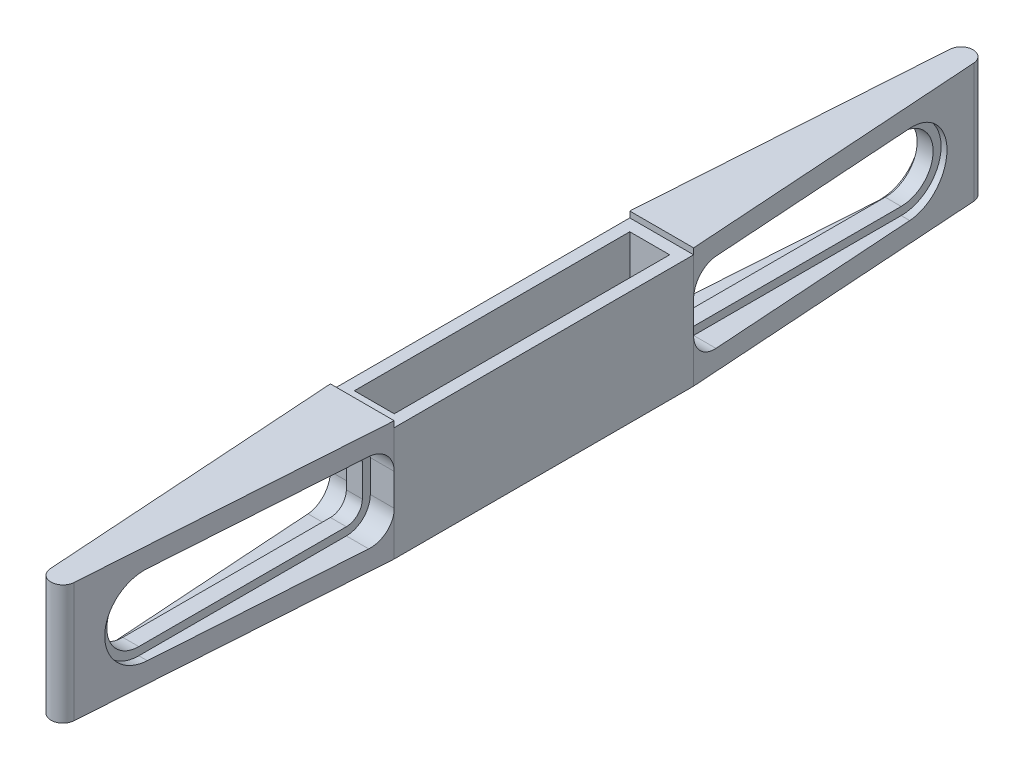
ISO-10303-21;
HEADER;
FILE_DESCRIPTION(('STEP AP214'),'2;1');
FILE_NAME('part.step','',(''),(''),'','','');
FILE_SCHEMA(('AUTOMOTIVE_DESIGN { 1 0 10303 214 1 1 1 1 }'));
ENDSEC;
DATA;
#1=APPLICATION_CONTEXT('core data for automotive mechanical design processes');
#2=APPLICATION_PROTOCOL_DEFINITION('international standard','automotive_design',2000,#1);
#3=PRODUCT_CONTEXT('',#1,'mechanical');
#4=PRODUCT('Part','Part','',(#3));
#5=PRODUCT_RELATED_PRODUCT_CATEGORY('part','',(#4));
#6=PRODUCT_DEFINITION_FORMATION('','',#4);
#7=PRODUCT_DEFINITION_CONTEXT('part definition',#1,'design');
#8=PRODUCT_DEFINITION('design','',#6,#7);
#9=PRODUCT_DEFINITION_SHAPE('','',#8);
#10=(LENGTH_UNIT() NAMED_UNIT(*) SI_UNIT(.MILLI.,.METRE.));
#11=(NAMED_UNIT(*) PLANE_ANGLE_UNIT() SI_UNIT($,.RADIAN.));
#12=(NAMED_UNIT(*) SI_UNIT($,.STERADIAN.) SOLID_ANGLE_UNIT());
#13=UNCERTAINTY_MEASURE_WITH_UNIT(LENGTH_MEASURE(1.E-05),#10,'distance_accuracy_value','');
#14=(GEOMETRIC_REPRESENTATION_CONTEXT(3) GLOBAL_UNCERTAINTY_ASSIGNED_CONTEXT((#13)) GLOBAL_UNIT_ASSIGNED_CONTEXT((#10,
#11,#12)) REPRESENTATION_CONTEXT('',''));
#15=CARTESIAN_POINT('',(0.,0.,0.));
#16=DIRECTION('',(0.,0.,1.));
#17=DIRECTION('',(1.,0.,0.));
#18=AXIS2_PLACEMENT_3D('',#15,#16,#17);
#19=CARTESIAN_POINT('',(8.,30.,-37.5));
#20=DIRECTION('',(1.,0.,0.));
#21=DIRECTION('',(0.,0.,-1.));
#22=AXIS2_PLACEMENT_3D('',#19,#20,#21);
#23=PLANE('',#22);
#24=DIRECTION('',(0.,-1.,0.));
#25=VECTOR('',#24,1.);
#26=CARTESIAN_POINT('',(8.,30.,-37.5));
#27=LINE('',#26,#25);
#28=CARTESIAN_POINT('',(8.,28.5,-37.5));
#29=VERTEX_POINT('',#28);
#30=CARTESIAN_POINT('',(8.,19.,-37.5));
#31=VERTEX_POINT('',#30);
#32=EDGE_CURVE('E617',#29,#31,#27,.T.);
#33=ORIENTED_EDGE('',*,*,#32,.F.);
#34=DIRECTION('',(0.,0.,1.));
#35=VECTOR('',#34,1.);
#36=CARTESIAN_POINT('',(8.,28.5,-37.5));
#37=LINE('',#36,#35);
#38=CARTESIAN_POINT('',(8.,28.5,37.5));
#39=VERTEX_POINT('',#38);
#40=EDGE_CURVE('E483',#29,#39,#37,.T.);
#41=ORIENTED_EDGE('',*,*,#40,.T.);
#42=DIRECTION('',(0.,-1.,0.));
#43=VECTOR('',#42,1.);
#44=CARTESIAN_POINT('',(8.,30.,37.5));
#45=LINE('',#44,#43);
#46=CARTESIAN_POINT('',(8.,19.,37.5));
#47=VERTEX_POINT('',#46);
#48=EDGE_CURVE('E642',#39,#47,#45,.T.);
#49=ORIENTED_EDGE('',*,*,#48,.T.);
#50=DIRECTION('',(0.,-1.,0.));
#51=VECTOR('',#50,1.);
#52=CARTESIAN_POINT('',(8.,25.,37.5));
#53=LINE('',#52,#51);
#54=CARTESIAN_POINT('',(8.,11.,37.5));
#55=VERTEX_POINT('',#54);
#56=EDGE_CURVE('E551',#47,#55,#53,.T.);
#57=ORIENTED_EDGE('',*,*,#56,.T.);
#58=CARTESIAN_POINT('',(8.,0.,37.5));
#59=VERTEX_POINT('',#58);
#60=EDGE_CURVE('E592',#55,#59,#45,.T.);
#61=ORIENTED_EDGE('',*,*,#60,.T.);
#62=DIRECTION('',(0.,0.,1.));
#63=VECTOR('',#62,1.);
#64=CARTESIAN_POINT('',(8.,0.,-37.5));
#65=LINE('',#64,#63);
#66=CARTESIAN_POINT('',(8.,0.,-37.5));
#67=VERTEX_POINT('',#66);
#68=EDGE_CURVE('E573',#67,#59,#65,.T.);
#69=ORIENTED_EDGE('',*,*,#68,.F.);
#70=CARTESIAN_POINT('',(8.,11.,-37.5));
#71=VERTEX_POINT('',#70);
#72=EDGE_CURVE('E616',#71,#67,#27,.T.);
#73=ORIENTED_EDGE('',*,*,#72,.F.);
#74=DIRECTION('',(0.,-1.,0.));
#75=VECTOR('',#74,1.);
#76=CARTESIAN_POINT('',(8.,25.,-37.5));
#77=LINE('',#76,#75);
#78=EDGE_CURVE('E489',#31,#71,#77,.T.);
#79=ORIENTED_EDGE('',*,*,#78,.F.);
#80=EDGE_LOOP('',(#33,#41,#49,#57,#61,#69,#73,#79));
#81=FACE_BOUND('',#80,.T.);
#82=ADVANCED_FACE('F43',(#81),#23,.T.);
#83=CARTESIAN_POINT('',(-8.,30.,-37.5));
#84=DIRECTION('',(1.,0.,0.));
#85=DIRECTION('',(0.,0.,-1.));
#86=AXIS2_PLACEMENT_3D('',#83,#84,#85);
#87=PLANE('',#86);
#88=DIRECTION('',(0.,0.,-1.));
#89=VECTOR('',#88,1.);
#90=CARTESIAN_POINT('',(-8.,28.5,37.5));
#91=LINE('',#90,#89);
#92=CARTESIAN_POINT('',(-8.,28.5,37.5));
#93=VERTEX_POINT('',#92);
#94=CARTESIAN_POINT('',(-8.00000000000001,28.5,-37.5));
#95=VERTEX_POINT('',#94);
#96=EDGE_CURVE('E477',#93,#95,#91,.T.);
#97=ORIENTED_EDGE('',*,*,#96,.T.);
#98=DIRECTION('',(0.,-1.,0.));
#99=VECTOR('',#98,1.);
#100=CARTESIAN_POINT('',(-8.,30.,-37.5));
#101=LINE('',#100,#99);
#102=CARTESIAN_POINT('',(-8.,19.,-37.5));
#103=VERTEX_POINT('',#102);
#104=EDGE_CURVE('E626',#95,#103,#101,.T.);
#105=ORIENTED_EDGE('',*,*,#104,.T.);
#106=DIRECTION('',(0.,-1.,0.));
#107=VECTOR('',#106,1.);
#108=CARTESIAN_POINT('',(-8.,25.,-37.5));
#109=LINE('',#108,#107);
#110=CARTESIAN_POINT('',(-8.,11.,-37.5));
#111=VERTEX_POINT('',#110);
#112=EDGE_CURVE('E513',#103,#111,#109,.T.);
#113=ORIENTED_EDGE('',*,*,#112,.T.);
#114=CARTESIAN_POINT('',(-8.,0.,-37.5));
#115=VERTEX_POINT('',#114);
#116=EDGE_CURVE('E630',#111,#115,#101,.T.);
#117=ORIENTED_EDGE('',*,*,#116,.T.);
#118=DIRECTION('',(0.,0.,1.));
#119=VECTOR('',#118,1.);
#120=CARTESIAN_POINT('',(-8.,0.,-37.5));
#121=LINE('',#120,#119);
#122=CARTESIAN_POINT('',(-8.,0.,37.5));
#123=VERTEX_POINT('',#122);
#124=EDGE_CURVE('E601',#115,#123,#121,.T.);
#125=ORIENTED_EDGE('',*,*,#124,.T.);
#126=DIRECTION('',(0.,-1.,0.));
#127=VECTOR('',#126,1.);
#128=CARTESIAN_POINT('',(-8.,30.,37.5));
#129=LINE('',#128,#127);
#130=CARTESIAN_POINT('',(-8.,11.,37.5));
#131=VERTEX_POINT('',#130);
#132=EDGE_CURVE('E635',#131,#123,#129,.T.);
#133=ORIENTED_EDGE('',*,*,#132,.F.);
#134=DIRECTION('',(0.,-1.,0.));
#135=VECTOR('',#134,1.);
#136=CARTESIAN_POINT('',(-8.,25.,37.5));
#137=LINE('',#136,#135);
#138=CARTESIAN_POINT('',(-8.,19.,37.5));
#139=VERTEX_POINT('',#138);
#140=EDGE_CURVE('E534',#139,#131,#137,.T.);
#141=ORIENTED_EDGE('',*,*,#140,.F.);
#142=EDGE_CURVE('E631',#93,#139,#129,.T.);
#143=ORIENTED_EDGE('',*,*,#142,.F.);
#144=EDGE_LOOP('',(#97,#105,#113,#117,#125,#133,#141,#143));
#145=FACE_BOUND('',#144,.T.);
#146=ADVANCED_FACE('F795',(#145),#87,.F.);
#147=CARTESIAN_POINT('',(0.,30.,112.5));
#148=DIRECTION('',(0.,1.,0.));
#149=DIRECTION('',(0.,0.,1.));
#150=AXIS2_PLACEMENT_3D('',#147,#148,#149);
#151=PLANE('',#150);
#152=DIRECTION('',(-1.,0.,0.));
#153=VECTOR('',#152,1.);
#154=CARTESIAN_POINT('',(8.,30.,-37.5));
#155=LINE('',#154,#153);
#156=CARTESIAN_POINT('',(8.,30.,-37.5));
#157=VERTEX_POINT('',#156);
#158=CARTESIAN_POINT('',(-8.00000000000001,30.,-37.5));
#159=VERTEX_POINT('',#158);
#160=EDGE_CURVE('E472',#157,#159,#155,.T.);
#161=ORIENTED_EDGE('',*,*,#160,.F.);
#162=DIRECTION('',(-0.0664310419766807,0.,-0.997791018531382));
#163=VECTOR('',#162,1.);
#164=CARTESIAN_POINT('',(8.,30.,-37.5));
#165=LINE('',#164,#163);
#166=CARTESIAN_POINT('',(2.99337305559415,30.,-112.69929312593));
#167=VERTEX_POINT('',#166);
#168=EDGE_CURVE('E587',#157,#167,#165,.T.);
#169=ORIENTED_EDGE('',*,*,#168,.T.);
#170=CARTESIAN_POINT('',(0.,30.,-112.5));
#171=DIRECTION('',(0.,-1.,0.));
#172=DIRECTION('',(0.,0.,-1.));
#173=AXIS2_PLACEMENT_3D('',#170,#171,#172);
#174=CIRCLE('',#173,3.);
#175=CARTESIAN_POINT('',(-2.99337305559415,30.,-112.69929312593));
#176=VERTEX_POINT('',#175);
#177=EDGE_CURVE('E588',#176,#167,#174,.T.);
#178=ORIENTED_EDGE('',*,*,#177,.F.);
#179=DIRECTION('',(0.0664310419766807,0.,-0.997791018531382));
#180=VECTOR('',#179,1.);
#181=CARTESIAN_POINT('',(-8.,30.,-37.5));
#182=LINE('',#181,#180);
#183=EDGE_CURVE('E585',#159,#176,#182,.T.);
#184=ORIENTED_EDGE('',*,*,#183,.F.);
#185=EDGE_LOOP('',(#161,#169,#178,#184));
#186=FACE_BOUND('',#185,.T.);
#187=ADVANCED_FACE('F798',(#186),#151,.T.);
#188=CARTESIAN_POINT('',(8.,30.,-37.5));
#189=DIRECTION('',(-0.997791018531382,0.,0.0664310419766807));
#190=DIRECTION('',(0.0664310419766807,0.,0.997791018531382));
#191=AXIS2_PLACEMENT_3D('',#188,#189,#190);
#192=PLANE('',#191);
#193=DIRECTION('',(0.0664310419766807,0.,0.997791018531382));
#194=VECTOR('',#193,1.);
#195=CARTESIAN_POINT('',(8.,25.,-37.5));
#196=LINE('',#195,#194);
#197=CARTESIAN_POINT('',(4.13846951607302,25.,-95.5));
#198=VERTEX_POINT('',#197);
#199=CARTESIAN_POINT('',(7.60053132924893,25.,-43.5));
#200=VERTEX_POINT('',#199);
#201=EDGE_CURVE('E734',#198,#200,#196,.T.);
#202=ORIENTED_EDGE('',*,*,#201,.F.);
#203=CARTESIAN_POINT('',(4.13846951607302,15.,-95.5));
#204=DIRECTION('',(-0.997791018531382,0.,0.0664310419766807));
#205=DIRECTION('',(0.0664310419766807,0.,0.997791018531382));
#206=AXIS2_PLACEMENT_3D('',#203,#204,#205);
#207=ELLIPSE('',#206,10.0221387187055,10.);
#208=CARTESIAN_POINT('',(4.13846951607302,4.99999999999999,-95.5));
#209=VERTEX_POINT('',#208);
#210=EDGE_CURVE('E730',#198,#209,#207,.T.);
#211=ORIENTED_EDGE('',*,*,#210,.T.);
#212=DIRECTION('',(0.0664310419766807,0.,0.997791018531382));
#213=VECTOR('',#212,1.);
#214=CARTESIAN_POINT('',(8.,5.,-37.5));
#215=LINE('',#214,#213);
#216=CARTESIAN_POINT('',(7.60053132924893,5.,-43.5));
#217=VERTEX_POINT('',#216);
#218=EDGE_CURVE('E724',#209,#217,#215,.T.);
#219=ORIENTED_EDGE('',*,*,#218,.T.);
#220=CARTESIAN_POINT('',(7.60053132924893,11.,-43.5));
#221=DIRECTION('',(-0.997791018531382,0.,0.0664310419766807));
#222=DIRECTION('',(-0.0664310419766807,0.,-0.997791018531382));
#223=AXIS2_PLACEMENT_3D('',#220,#221,#222);
#224=ELLIPSE('',#223,6.01328323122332,6.);
#225=EDGE_CURVE('E749',#217,#71,#224,.T.);
#226=ORIENTED_EDGE('',*,*,#225,.T.);
#227=ORIENTED_EDGE('',*,*,#72,.T.);
#228=DIRECTION('',(-0.0664310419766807,0.,-0.997791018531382));
#229=VECTOR('',#228,1.);
#230=CARTESIAN_POINT('',(8.,0.,-37.5));
#231=LINE('',#230,#229);
#232=CARTESIAN_POINT('',(2.99337305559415,0.,-112.69929312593));
#233=VERTEX_POINT('',#232);
#234=EDGE_CURVE('E576',#67,#233,#231,.T.);
#235=ORIENTED_EDGE('',*,*,#234,.T.);
#236=DIRECTION('',(0.,-1.,0.));
#237=VECTOR('',#236,1.);
#238=CARTESIAN_POINT('',(2.99337305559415,30.,-112.69929312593));
#239=LINE('',#238,#237);
#240=EDGE_CURVE('E620',#167,#233,#239,.T.);
#241=ORIENTED_EDGE('',*,*,#240,.F.);
#242=ORIENTED_EDGE('',*,*,#168,.F.);
#243=EDGE_CURVE('E614',#157,#29,#27,.T.);
#244=ORIENTED_EDGE('',*,*,#243,.T.);
#245=ORIENTED_EDGE('',*,*,#32,.T.);
#246=CARTESIAN_POINT('',(7.60053132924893,19.,-43.5));
#247=DIRECTION('',(-0.997791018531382,0.,0.0664310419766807));
#248=DIRECTION('',(0.0664310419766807,0.,0.997791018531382));
#249=AXIS2_PLACEMENT_3D('',#246,#247,#248);
#250=ELLIPSE('',#249,6.01328323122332,6.);
#251=EDGE_CURVE('E751',#31,#200,#250,.T.);
#252=ORIENTED_EDGE('',*,*,#251,.T.);
#253=EDGE_LOOP('',(#202,#211,#219,#226,#227,#235,#241,#242,#244,#245,#252));
#254=FACE_BOUND('',#253,.T.);
#255=ADVANCED_FACE('F872',(#254),#192,.F.);
#256=CARTESIAN_POINT('',(-8.,30.,-37.5));
#257=DIRECTION('',(-0.997791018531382,0.,-0.0664310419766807));
#258=DIRECTION('',(-0.0664310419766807,0.,0.997791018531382));
#259=AXIS2_PLACEMENT_3D('',#256,#257,#258);
#260=PLANE('',#259);
#261=ORIENTED_EDGE('',*,*,#116,.F.);
#262=CARTESIAN_POINT('',(-7.60053132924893,11.,-43.5));
#263=DIRECTION('',(-0.997791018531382,0.,-0.0664310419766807));
#264=DIRECTION('',(0.0664310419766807,0.,-0.997791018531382));
#265=AXIS2_PLACEMENT_3D('',#262,#263,#264);
#266=ELLIPSE('',#265,6.01328323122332,6.);
#267=CARTESIAN_POINT('',(-7.60053132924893,5.,-43.5));
#268=VERTEX_POINT('',#267);
#269=EDGE_CURVE('E717',#111,#268,#266,.F.);
#270=ORIENTED_EDGE('',*,*,#269,.T.);
#271=DIRECTION('',(0.0664310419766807,0.,-0.997791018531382));
#272=VECTOR('',#271,1.);
#273=CARTESIAN_POINT('',(-8.,5.,-37.5));
#274=LINE('',#273,#272);
#275=CARTESIAN_POINT('',(-4.13846951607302,4.99999999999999,-95.5));
#276=VERTEX_POINT('',#275);
#277=EDGE_CURVE('E705',#268,#276,#274,.T.);
#278=ORIENTED_EDGE('',*,*,#277,.T.);
#279=CARTESIAN_POINT('',(-4.13846951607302,15.,-95.5));
#280=DIRECTION('',(-0.997791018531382,0.,-0.0664310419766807));
#281=DIRECTION('',(-0.0664310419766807,0.,0.997791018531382));
#282=AXIS2_PLACEMENT_3D('',#279,#280,#281);
#283=ELLIPSE('',#282,10.0221387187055,10.);
#284=CARTESIAN_POINT('',(-4.13846951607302,25.,-95.5));
#285=VERTEX_POINT('',#284);
#286=EDGE_CURVE('E697',#276,#285,#283,.F.);
#287=ORIENTED_EDGE('',*,*,#286,.T.);
#288=DIRECTION('',(0.0664310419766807,0.,-0.997791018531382));
#289=VECTOR('',#288,1.);
#290=CARTESIAN_POINT('',(-8.,25.,-37.5));
#291=LINE('',#290,#289);
#292=CARTESIAN_POINT('',(-7.60053132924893,25.,-43.5));
#293=VERTEX_POINT('',#292);
#294=EDGE_CURVE('E696',#293,#285,#291,.T.);
#295=ORIENTED_EDGE('',*,*,#294,.F.);
#296=CARTESIAN_POINT('',(-7.60053132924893,19.,-43.5));
#297=DIRECTION('',(-0.997791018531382,0.,-0.0664310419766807));
#298=DIRECTION('',(-0.0664310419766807,0.,0.997791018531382));
#299=AXIS2_PLACEMENT_3D('',#296,#297,#298);
#300=ELLIPSE('',#299,6.01328323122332,6.);
#301=EDGE_CURVE('E722',#293,#103,#300,.F.);
#302=ORIENTED_EDGE('',*,*,#301,.T.);
#303=ORIENTED_EDGE('',*,*,#104,.F.);
#304=EDGE_CURVE('E624',#159,#95,#101,.T.);
#305=ORIENTED_EDGE('',*,*,#304,.F.);
#306=ORIENTED_EDGE('',*,*,#183,.T.);
#307=DIRECTION('',(0.,-1.,0.));
#308=VECTOR('',#307,1.);
#309=CARTESIAN_POINT('',(-2.99337305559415,30.,-112.69929312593));
#310=LINE('',#309,#308);
#311=CARTESIAN_POINT('',(-2.99337305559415,0.,-112.69929312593));
#312=VERTEX_POINT('',#311);
#313=EDGE_CURVE('E625',#176,#312,#310,.T.);
#314=ORIENTED_EDGE('',*,*,#313,.T.);
#315=DIRECTION('',(0.0664310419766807,0.,-0.997791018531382));
#316=VECTOR('',#315,1.);
#317=CARTESIAN_POINT('',(-8.,0.,-37.5));
#318=LINE('',#317,#316);
#319=EDGE_CURVE('E602',#115,#312,#318,.T.);
#320=ORIENTED_EDGE('',*,*,#319,.F.);
#321=EDGE_LOOP('',(#261,#270,#278,#287,#295,#302,#303,#305,#306,#314,#320));
#322=FACE_BOUND('',#321,.T.);
#323=ADVANCED_FACE('F881',(#322),#260,.T.);
#324=CARTESIAN_POINT('',(-8.,30.,37.5));
#325=DIRECTION('',(0.997791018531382,0.,-0.0664310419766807));
#326=DIRECTION('',(-0.0664310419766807,0.,-0.997791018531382));
#327=AXIS2_PLACEMENT_3D('',#324,#325,#326);
#328=PLANE('',#327);
#329=DIRECTION('',(-0.0664310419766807,0.,-0.997791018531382));
#330=VECTOR('',#329,1.);
#331=CARTESIAN_POINT('',(-8.,25.,37.5));
#332=LINE('',#331,#330);
#333=CARTESIAN_POINT('',(-4.13846951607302,25.,95.5));
#334=VERTEX_POINT('',#333);
#335=CARTESIAN_POINT('',(-7.60053132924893,25.,43.5));
#336=VERTEX_POINT('',#335);
#337=EDGE_CURVE('E671',#334,#336,#332,.T.);
#338=ORIENTED_EDGE('',*,*,#337,.F.);
#339=CARTESIAN_POINT('',(-4.13846951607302,15.,95.5));
#340=DIRECTION('',(0.997791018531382,0.,-0.0664310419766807));
#341=DIRECTION('',(-0.0664310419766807,0.,-0.997791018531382));
#342=AXIS2_PLACEMENT_3D('',#339,#340,#341);
#343=ELLIPSE('',#342,10.0221387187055,10.);
#344=CARTESIAN_POINT('',(-4.13846951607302,4.99999999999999,95.5));
#345=VERTEX_POINT('',#344);
#346=EDGE_CURVE('E672',#334,#345,#343,.T.);
#347=ORIENTED_EDGE('',*,*,#346,.T.);
#348=DIRECTION('',(-0.0664310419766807,0.,-0.997791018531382));
#349=VECTOR('',#348,1.);
#350=CARTESIAN_POINT('',(-8.,5.,37.5));
#351=LINE('',#350,#349);
#352=CARTESIAN_POINT('',(-7.60053132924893,5.,43.5));
#353=VERTEX_POINT('',#352);
#354=EDGE_CURVE('E670',#345,#353,#351,.T.);
#355=ORIENTED_EDGE('',*,*,#354,.T.);
#356=CARTESIAN_POINT('',(-7.60053132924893,11.,43.5));
#357=DIRECTION('',(0.997791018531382,0.,-0.0664310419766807));
#358=DIRECTION('',(0.0664310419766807,0.,0.997791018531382));
#359=AXIS2_PLACEMENT_3D('',#356,#357,#358);
#360=ELLIPSE('',#359,6.01328323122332,6.);
#361=EDGE_CURVE('E691',#353,#131,#360,.T.);
#362=ORIENTED_EDGE('',*,*,#361,.T.);
#363=ORIENTED_EDGE('',*,*,#132,.T.);
#364=DIRECTION('',(0.0664310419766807,0.,0.997791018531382));
#365=VECTOR('',#364,1.);
#366=CARTESIAN_POINT('',(-8.,0.,37.5));
#367=LINE('',#366,#365);
#368=CARTESIAN_POINT('',(-2.99337305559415,0.,112.69929312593));
#369=VERTEX_POINT('',#368);
#370=EDGE_CURVE('E598',#123,#369,#367,.T.);
#371=ORIENTED_EDGE('',*,*,#370,.T.);
#372=DIRECTION('',(0.,-1.,0.));
#373=VECTOR('',#372,1.);
#374=CARTESIAN_POINT('',(-2.99337305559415,30.,112.69929312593));
#375=LINE('',#374,#373);
#376=CARTESIAN_POINT('',(-2.99337305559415,30.,112.69929312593));
#377=VERTEX_POINT('',#376);
#378=EDGE_CURVE('E633',#377,#369,#375,.T.);
#379=ORIENTED_EDGE('',*,*,#378,.F.);
#380=DIRECTION('',(0.0664310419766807,0.,0.997791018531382));
#381=VECTOR('',#380,1.);
#382=CARTESIAN_POINT('',(-8.,30.,37.5));
#383=LINE('',#382,#381);
#384=CARTESIAN_POINT('',(-8.,30.,37.5));
#385=VERTEX_POINT('',#384);
#386=EDGE_CURVE('E584',#385,#377,#383,.T.);
#387=ORIENTED_EDGE('',*,*,#386,.F.);
#388=EDGE_CURVE('E628',#385,#93,#129,.T.);
#389=ORIENTED_EDGE('',*,*,#388,.T.);
#390=ORIENTED_EDGE('',*,*,#142,.T.);
#391=CARTESIAN_POINT('',(-7.60053132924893,19.,43.5));
#392=DIRECTION('',(0.997791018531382,0.,-0.0664310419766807));
#393=DIRECTION('',(-0.0664310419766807,0.,-0.997791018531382));
#394=AXIS2_PLACEMENT_3D('',#391,#392,#393);
#395=ELLIPSE('',#394,6.01328323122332,6.);
#396=EDGE_CURVE('E692',#139,#336,#395,.T.);
#397=ORIENTED_EDGE('',*,*,#396,.T.);
#398=EDGE_LOOP('',(#338,#347,#355,#362,#363,#371,#379,#387,#389,#390,#397));
#399=FACE_BOUND('',#398,.T.);
#400=ADVANCED_FACE('F900',(#399),#328,.F.);
#401=CARTESIAN_POINT('',(8.,30.,37.5));
#402=DIRECTION('',(0.997791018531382,0.,0.0664310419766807));
#403=DIRECTION('',(0.0664310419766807,0.,-0.997791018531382));
#404=AXIS2_PLACEMENT_3D('',#401,#402,#403);
#405=PLANE('',#404);
#406=ORIENTED_EDGE('',*,*,#60,.F.);
#407=CARTESIAN_POINT('',(7.60053132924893,11.,43.5));
#408=DIRECTION('',(0.997791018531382,0.,0.0664310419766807));
#409=DIRECTION('',(-0.0664310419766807,0.,0.997791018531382));
#410=AXIS2_PLACEMENT_3D('',#407,#408,#409);
#411=ELLIPSE('',#410,6.01328323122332,6.);
#412=CARTESIAN_POINT('',(7.60053132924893,5.,43.5));
#413=VERTEX_POINT('',#412);
#414=EDGE_CURVE('E661',#55,#413,#411,.F.);
#415=ORIENTED_EDGE('',*,*,#414,.T.);
#416=DIRECTION('',(-0.0664310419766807,0.,0.997791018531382));
#417=VECTOR('',#416,1.);
#418=CARTESIAN_POINT('',(8.,5.,37.5));
#419=LINE('',#418,#417);
#420=CARTESIAN_POINT('',(4.13846951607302,4.99999999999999,95.5));
#421=VERTEX_POINT('',#420);
#422=EDGE_CURVE('E646',#413,#421,#419,.T.);
#423=ORIENTED_EDGE('',*,*,#422,.T.);
#424=CARTESIAN_POINT('',(4.13846951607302,15.,95.5));
#425=DIRECTION('',(0.997791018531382,0.,0.0664310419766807));
#426=DIRECTION('',(0.0664310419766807,0.,-0.997791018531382));
#427=AXIS2_PLACEMENT_3D('',#424,#425,#426);
#428=ELLIPSE('',#427,10.0221387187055,10.);
#429=CARTESIAN_POINT('',(4.13846951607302,25.,95.5));
#430=VERTEX_POINT('',#429);
#431=EDGE_CURVE('E644',#421,#430,#428,.F.);
#432=ORIENTED_EDGE('',*,*,#431,.T.);
#433=DIRECTION('',(-0.0664310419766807,0.,0.997791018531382));
#434=VECTOR('',#433,1.);
#435=CARTESIAN_POINT('',(8.,25.,37.5));
#436=LINE('',#435,#434);
#437=CARTESIAN_POINT('',(7.60053132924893,25.,43.5));
#438=VERTEX_POINT('',#437);
#439=EDGE_CURVE('E618',#438,#430,#436,.T.);
#440=ORIENTED_EDGE('',*,*,#439,.F.);
#441=CARTESIAN_POINT('',(7.60053132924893,19.,43.5));
#442=DIRECTION('',(0.997791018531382,0.,0.0664310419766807));
#443=DIRECTION('',(0.0664310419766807,0.,-0.997791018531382));
#444=AXIS2_PLACEMENT_3D('',#441,#442,#443);
#445=ELLIPSE('',#444,6.01328323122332,6.);
#446=EDGE_CURVE('E663',#438,#47,#445,.F.);
#447=ORIENTED_EDGE('',*,*,#446,.T.);
#448=ORIENTED_EDGE('',*,*,#48,.F.);
#449=CARTESIAN_POINT('',(8.,30.,37.5));
#450=VERTEX_POINT('',#449);
#451=EDGE_CURVE('E638',#450,#39,#45,.T.);
#452=ORIENTED_EDGE('',*,*,#451,.F.);
#453=DIRECTION('',(-0.0664310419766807,0.,0.997791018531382));
#454=VECTOR('',#453,1.);
#455=CARTESIAN_POINT('',(8.,30.,37.5));
#456=LINE('',#455,#454);
#457=CARTESIAN_POINT('',(2.99337305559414,30.,112.69929312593));
#458=VERTEX_POINT('',#457);
#459=EDGE_CURVE('E574',#450,#458,#456,.T.);
#460=ORIENTED_EDGE('',*,*,#459,.T.);
#461=DIRECTION('',(0.,-1.,0.));
#462=VECTOR('',#461,1.);
#463=CARTESIAN_POINT('',(2.99337305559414,30.,112.69929312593));
#464=LINE('',#463,#462);
#465=CARTESIAN_POINT('',(2.99337305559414,0.,112.69929312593));
#466=VERTEX_POINT('',#465);
#467=EDGE_CURVE('E636',#458,#466,#464,.T.);
#468=ORIENTED_EDGE('',*,*,#467,.T.);
#469=DIRECTION('',(-0.0664310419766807,0.,0.997791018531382));
#470=VECTOR('',#469,1.);
#471=CARTESIAN_POINT('',(8.,0.,37.5));
#472=LINE('',#471,#470);
#473=EDGE_CURVE('E594',#59,#466,#472,.T.);
#474=ORIENTED_EDGE('',*,*,#473,.F.);
#475=EDGE_LOOP('',(#406,#415,#423,#432,#440,#447,#448,#452,#460,#468,#474));
#476=FACE_BOUND('',#475,.T.);
#477=ADVANCED_FACE('F803',(#476),#405,.T.);
#478=CARTESIAN_POINT('',(0.,30.,-112.5));
#479=DIRECTION('',(0.,-1.,0.));
#480=DIRECTION('',(0.,0.,-1.));
#481=AXIS2_PLACEMENT_3D('',#478,#479,#480);
#482=CYLINDRICAL_SURFACE('',#481,3.);
#483=CARTESIAN_POINT('',(0.,0.,-112.5));
#484=DIRECTION('',(0.,-1.,0.));
#485=DIRECTION('',(0.,0.,-1.));
#486=AXIS2_PLACEMENT_3D('',#483,#484,#485);
#487=CIRCLE('',#486,3.);
#488=EDGE_CURVE('E610',#312,#233,#487,.T.);
#489=ORIENTED_EDGE('',*,*,#488,.F.);
#490=ORIENTED_EDGE('',*,*,#313,.F.);
#491=ORIENTED_EDGE('',*,*,#177,.T.);
#492=ORIENTED_EDGE('',*,*,#240,.T.);
#493=EDGE_LOOP('',(#489,#490,#491,#492));
#494=FACE_BOUND('',#493,.T.);
#495=ADVANCED_FACE('F956',(#494),#482,.T.);
#496=CARTESIAN_POINT('',(0.,30.,112.5));
#497=DIRECTION('',(0.,-1.,0.));
#498=DIRECTION('',(0.,0.,-1.));
#499=AXIS2_PLACEMENT_3D('',#496,#497,#498);
#500=CYLINDRICAL_SURFACE('',#499,3.);
#501=CARTESIAN_POINT('',(0.,0.,112.5));
#502=DIRECTION('',(0.,1.,0.));
#503=DIRECTION('',(0.,0.,1.));
#504=AXIS2_PLACEMENT_3D('',#501,#502,#503);
#505=CIRCLE('',#504,3.);
#506=EDGE_CURVE('E600',#369,#466,#505,.T.);
#507=ORIENTED_EDGE('',*,*,#506,.T.);
#508=ORIENTED_EDGE('',*,*,#467,.F.);
#509=CARTESIAN_POINT('',(0.,30.,112.5));
#510=DIRECTION('',(0.,1.,0.));
#511=DIRECTION('',(0.,0.,1.));
#512=AXIS2_PLACEMENT_3D('',#509,#510,#511);
#513=CIRCLE('',#512,3.);
#514=EDGE_CURVE('E579',#377,#458,#513,.T.);
#515=ORIENTED_EDGE('',*,*,#514,.F.);
#516=ORIENTED_EDGE('',*,*,#378,.T.);
#517=EDGE_LOOP('',(#507,#508,#515,#516));
#518=FACE_BOUND('',#517,.T.);
#519=ADVANCED_FACE('F947',(#518),#500,.T.);
#520=DIRECTION('',(1.,0.,0.));
#521=VECTOR('',#520,1.);
#522=CARTESIAN_POINT('',(-8.,30.,37.5));
#523=LINE('',#522,#521);
#524=EDGE_CURVE('E478',#385,#450,#523,.T.);
#525=ORIENTED_EDGE('',*,*,#524,.F.);
#526=ORIENTED_EDGE('',*,*,#386,.T.);
#527=ORIENTED_EDGE('',*,*,#514,.T.);
#528=ORIENTED_EDGE('',*,*,#459,.F.);
#529=EDGE_LOOP('',(#525,#526,#527,#528));
#530=FACE_BOUND('',#529,.T.);
#531=ADVANCED_FACE('F903',(#530),#151,.T.);
#532=CARTESIAN_POINT('',(0.,0.,112.5));
#533=DIRECTION('',(0.,1.,0.));
#534=DIRECTION('',(0.,0.,1.));
#535=AXIS2_PLACEMENT_3D('',#532,#533,#534);
#536=PLANE('',#535);
#537=ORIENTED_EDGE('',*,*,#68,.T.);
#538=ORIENTED_EDGE('',*,*,#473,.T.);
#539=ORIENTED_EDGE('',*,*,#506,.F.);
#540=ORIENTED_EDGE('',*,*,#370,.F.);
#541=ORIENTED_EDGE('',*,*,#124,.F.);
#542=ORIENTED_EDGE('',*,*,#319,.T.);
#543=ORIENTED_EDGE('',*,*,#488,.T.);
#544=ORIENTED_EDGE('',*,*,#234,.F.);
#545=EDGE_LOOP('',(#537,#538,#539,#540,#541,#542,#543,#544));
#546=FACE_BOUND('',#545,.T.);
#547=ADVANCED_FACE('F945',(#546),#536,.F.);
#548=CARTESIAN_POINT('',(2.,25.,37.5));
#549=DIRECTION('',(0.,0.,1.));
#550=DIRECTION('',(1.,0.,0.));
#551=AXIS2_PLACEMENT_3D('',#548,#549,#550);
#552=PLANE('',#551);
#553=DIRECTION('',(0.,-1.,0.));
#554=VECTOR('',#553,1.);
#555=CARTESIAN_POINT('',(2.,25.,37.5));
#556=LINE('',#555,#554);
#557=CARTESIAN_POINT('',(2.,19.,37.5));
#558=VERTEX_POINT('',#557);
#559=CARTESIAN_POINT('',(2.,11.,37.5));
#560=VERTEX_POINT('',#559);
#561=EDGE_CURVE('E555',#558,#560,#556,.T.);
#562=ORIENTED_EDGE('',*,*,#561,.T.);
#563=DIRECTION('',(1.,0.,0.));
#564=VECTOR('',#563,1.);
#565=CARTESIAN_POINT('',(8.,11.,37.5));
#566=LINE('',#565,#564);
#567=EDGE_CURVE('E653',#560,#55,#566,.T.);
#568=ORIENTED_EDGE('',*,*,#567,.T.);
#569=ORIENTED_EDGE('',*,*,#56,.F.);
#570=DIRECTION('',(1.,0.,0.));
#571=VECTOR('',#570,1.);
#572=CARTESIAN_POINT('',(2.,19.,37.5));
#573=LINE('',#572,#571);
#574=EDGE_CURVE('E648',#47,#558,#573,.F.);
#575=ORIENTED_EDGE('',*,*,#574,.T.);
#576=EDGE_LOOP('',(#562,#568,#569,#575));
#577=FACE_BOUND('',#576,.T.);
#578=ADVANCED_FACE('F911',(#577),#552,.T.);
#579=CARTESIAN_POINT('',(2.,5.,37.5));
#580=DIRECTION('',(0.,1.,0.));
#581=DIRECTION('',(0.,0.,1.));
#582=AXIS2_PLACEMENT_3D('',#579,#580,#581);
#583=PLANE('',#582);
#584=ORIENTED_EDGE('',*,*,#422,.F.);
#585=DIRECTION('',(1.,0.,0.));
#586=VECTOR('',#585,1.);
#587=CARTESIAN_POINT('',(2.,5.,43.5));
#588=LINE('',#587,#586);
#589=CARTESIAN_POINT('',(2.,5.,43.5));
#590=VERTEX_POINT('',#589);
#591=EDGE_CURVE('E652',#413,#590,#588,.F.);
#592=ORIENTED_EDGE('',*,*,#591,.T.);
#593=DIRECTION('',(0.,0.,1.));
#594=VECTOR('',#593,1.);
#595=CARTESIAN_POINT('',(2.,5.,37.5));
#596=LINE('',#595,#594);
#597=CARTESIAN_POINT('',(2.,4.99999999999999,95.5));
#598=VERTEX_POINT('',#597);
#599=EDGE_CURVE('E556',#590,#598,#596,.T.);
#600=ORIENTED_EDGE('',*,*,#599,.T.);
#601=DIRECTION('',(1.,0.,0.));
#602=VECTOR('',#601,1.);
#603=CARTESIAN_POINT('',(2.,4.99999999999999,95.5));
#604=LINE('',#603,#602);
#605=EDGE_CURVE('E571',#598,#421,#604,.T.);
#606=ORIENTED_EDGE('',*,*,#605,.T.);
#607=EDGE_LOOP('',(#584,#592,#600,#606));
#608=FACE_BOUND('',#607,.T.);
#609=ADVANCED_FACE('F931',(#608),#583,.T.);
#610=CARTESIAN_POINT('',(2.,15.,95.5));
#611=DIRECTION('',(1.,0.,0.));
#612=DIRECTION('',(0.,0.,-1.));
#613=AXIS2_PLACEMENT_3D('',#610,#611,#612);
#614=CYLINDRICAL_SURFACE('',#613,10.);
#615=ORIENTED_EDGE('',*,*,#605,.F.);
#616=CARTESIAN_POINT('',(2.,15.,95.5));
#617=DIRECTION('',(-1.,0.,0.));
#618=DIRECTION('',(0.,0.,1.));
#619=AXIS2_PLACEMENT_3D('',#616,#617,#618);
#620=CIRCLE('',#619,10.);
#621=CARTESIAN_POINT('',(2.,25.,95.5));
#622=VERTEX_POINT('',#621);
#623=EDGE_CURVE('E557',#598,#622,#620,.T.);
#624=ORIENTED_EDGE('',*,*,#623,.T.);
#625=DIRECTION('',(1.,0.,0.));
#626=VECTOR('',#625,1.);
#627=CARTESIAN_POINT('',(2.,25.,95.5));
#628=LINE('',#627,#626);
#629=EDGE_CURVE('E566',#622,#430,#628,.T.);
#630=ORIENTED_EDGE('',*,*,#629,.T.);
#631=ORIENTED_EDGE('',*,*,#431,.F.);
#632=EDGE_LOOP('',(#615,#624,#630,#631));
#633=FACE_BOUND('',#632,.T.);
#634=ADVANCED_FACE('F928',(#633),#614,.F.);
#635=CARTESIAN_POINT('',(2.,25.,37.5));
#636=DIRECTION('',(0.,1.,0.));
#637=DIRECTION('',(0.,0.,1.));
#638=AXIS2_PLACEMENT_3D('',#635,#636,#637);
#639=PLANE('',#638);
#640=DIRECTION('',(0.,0.,1.));
#641=VECTOR('',#640,1.);
#642=CARTESIAN_POINT('',(2.,25.,37.5));
#643=LINE('',#642,#641);
#644=CARTESIAN_POINT('',(2.,25.,43.5));
#645=VERTEX_POINT('',#644);
#646=EDGE_CURVE('E562',#645,#622,#643,.T.);
#647=ORIENTED_EDGE('',*,*,#646,.F.);
#648=DIRECTION('',(1.,0.,0.));
#649=VECTOR('',#648,1.);
#650=CARTESIAN_POINT('',(2.,25.,43.5));
#651=LINE('',#650,#649);
#652=EDGE_CURVE('E656',#645,#438,#651,.T.);
#653=ORIENTED_EDGE('',*,*,#652,.T.);
#654=ORIENTED_EDGE('',*,*,#439,.T.);
#655=ORIENTED_EDGE('',*,*,#629,.F.);
#656=EDGE_LOOP('',(#647,#653,#654,#655));
#657=FACE_BOUND('',#656,.T.);
#658=ADVANCED_FACE('F923',(#657),#639,.F.);
#659=CARTESIAN_POINT('',(2.,15.,95.5));
#660=DIRECTION('',(-1.,0.,0.));
#661=DIRECTION('',(0.,0.,1.));
#662=AXIS2_PLACEMENT_3D('',#659,#660,#661);
#663=PLANE('',#662);
#664=DIRECTION('',(0.,0.,-1.));
#665=VECTOR('',#664,1.);
#666=CARTESIAN_POINT('',(2.,6.99999999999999,95.5));
#667=LINE('',#666,#665);
#668=CARTESIAN_POINT('',(2.,6.99999999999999,95.5));
#669=VERTEX_POINT('',#668);
#670=CARTESIAN_POINT('',(2.,7.,43.5));
#671=VERTEX_POINT('',#670);
#672=EDGE_CURVE('E375',#669,#671,#667,.T.);
#673=ORIENTED_EDGE('',*,*,#672,.F.);
#674=CARTESIAN_POINT('',(2.,15.,95.5));
#675=DIRECTION('',(1.,0.,0.));
#676=DIRECTION('',(0.,0.,-1.));
#677=AXIS2_PLACEMENT_3D('',#674,#675,#676);
#678=CIRCLE('',#677,8.);
#679=CARTESIAN_POINT('',(2.,23.,95.5));
#680=VERTEX_POINT('',#679);
#681=EDGE_CURVE('E59',#680,#669,#678,.T.);
#682=ORIENTED_EDGE('',*,*,#681,.F.);
#683=DIRECTION('',(0.,0.,1.));
#684=VECTOR('',#683,1.);
#685=CARTESIAN_POINT('',(2.,23.,43.5));
#686=LINE('',#685,#684);
#687=CARTESIAN_POINT('',(2.,23.,43.5));
#688=VERTEX_POINT('',#687);
#689=EDGE_CURVE('E390',#688,#680,#686,.T.);
#690=ORIENTED_EDGE('',*,*,#689,.F.);
#691=CARTESIAN_POINT('',(2.,19.,43.5));
#692=DIRECTION('',(1.,0.,0.));
#693=DIRECTION('',(0.,0.,-1.));
#694=AXIS2_PLACEMENT_3D('',#691,#692,#693);
#695=CIRCLE('',#694,4.);
#696=CARTESIAN_POINT('',(2.,19.,39.5));
#697=VERTEX_POINT('',#696);
#698=EDGE_CURVE('E385',#697,#688,#695,.T.);
#699=ORIENTED_EDGE('',*,*,#698,.F.);
#700=DIRECTION('',(0.,1.,0.));
#701=VECTOR('',#700,1.);
#702=CARTESIAN_POINT('',(2.,11.,39.5));
#703=LINE('',#702,#701);
#704=CARTESIAN_POINT('',(2.,11.,39.5));
#705=VERTEX_POINT('',#704);
#706=EDGE_CURVE('E379',#705,#697,#703,.T.);
#707=ORIENTED_EDGE('',*,*,#706,.F.);
#708=CARTESIAN_POINT('',(2.,11.,43.5));
#709=DIRECTION('',(1.,0.,0.));
#710=DIRECTION('',(0.,0.,-1.));
#711=AXIS2_PLACEMENT_3D('',#708,#709,#710);
#712=CIRCLE('',#711,4.);
#713=EDGE_CURVE('E361',#671,#705,#712,.T.);
#714=ORIENTED_EDGE('',*,*,#713,.F.);
#715=EDGE_LOOP('',(#673,#682,#690,#699,#707,#714));
#716=FACE_BOUND('',#715,.T.);
#717=ORIENTED_EDGE('',*,*,#599,.F.);
#718=CARTESIAN_POINT('',(2.,11.,43.5));
#719=DIRECTION('',(-1.,0.,0.));
#720=DIRECTION('',(0.,0.,1.));
#721=AXIS2_PLACEMENT_3D('',#718,#719,#720);
#722=CIRCLE('',#721,6.);
#723=EDGE_CURVE('E658',#590,#560,#722,.F.);
#724=ORIENTED_EDGE('',*,*,#723,.T.);
#725=ORIENTED_EDGE('',*,*,#561,.F.);
#726=CARTESIAN_POINT('',(2.,19.,43.5));
#727=DIRECTION('',(-1.,0.,0.));
#728=DIRECTION('',(0.,0.,1.));
#729=AXIS2_PLACEMENT_3D('',#726,#727,#728);
#730=CIRCLE('',#729,6.);
#731=EDGE_CURVE('E657',#558,#645,#730,.F.);
#732=ORIENTED_EDGE('',*,*,#731,.T.);
#733=ORIENTED_EDGE('',*,*,#646,.T.);
#734=ORIENTED_EDGE('',*,*,#623,.F.);
#735=EDGE_LOOP('',(#717,#724,#725,#732,#733,#734));
#736=FACE_BOUND('',#735,.T.);
#737=ADVANCED_FACE('F376',(#716,#736),#663,.F.);
#738=CARTESIAN_POINT('',(2.,11.,43.5));
#739=DIRECTION('',(-1.,0.,0.));
#740=DIRECTION('',(0.,0.,1.));
#741=AXIS2_PLACEMENT_3D('',#738,#739,#740);
#742=CYLINDRICAL_SURFACE('',#741,6.);
#743=ORIENTED_EDGE('',*,*,#723,.F.);
#744=ORIENTED_EDGE('',*,*,#591,.F.);
#745=ORIENTED_EDGE('',*,*,#414,.F.);
#746=ORIENTED_EDGE('',*,*,#567,.F.);
#747=EDGE_LOOP('',(#743,#744,#745,#746));
#748=FACE_BOUND('',#747,.T.);
#749=ADVANCED_FACE('F807',(#748),#742,.F.);
#750=CARTESIAN_POINT('',(2.,19.,43.5));
#751=DIRECTION('',(1.,0.,0.));
#752=DIRECTION('',(0.,0.,-1.));
#753=AXIS2_PLACEMENT_3D('',#750,#751,#752);
#754=CYLINDRICAL_SURFACE('',#753,6.);
#755=ORIENTED_EDGE('',*,*,#731,.F.);
#756=ORIENTED_EDGE('',*,*,#574,.F.);
#757=ORIENTED_EDGE('',*,*,#446,.F.);
#758=ORIENTED_EDGE('',*,*,#652,.F.);
#759=EDGE_LOOP('',(#755,#756,#757,#758));
#760=FACE_BOUND('',#759,.T.);
#761=ADVANCED_FACE('F810',(#760),#754,.F.);
#762=CARTESIAN_POINT('',(-2.,25.,37.5));
#763=DIRECTION('',(0.,-1.,0.));
#764=DIRECTION('',(0.,0.,-1.));
#765=AXIS2_PLACEMENT_3D('',#762,#763,#764);
#766=PLANE('',#765);
#767=ORIENTED_EDGE('',*,*,#337,.T.);
#768=DIRECTION('',(-1.,0.,0.));
#769=VECTOR('',#768,1.);
#770=CARTESIAN_POINT('',(-2.,25.,43.5));
#771=LINE('',#770,#769);
#772=CARTESIAN_POINT('',(-2.,25.,43.5));
#773=VERTEX_POINT('',#772);
#774=EDGE_CURVE('E689',#336,#773,#771,.F.);
#775=ORIENTED_EDGE('',*,*,#774,.T.);
#776=DIRECTION('',(0.,0.,1.));
#777=VECTOR('',#776,1.);
#778=CARTESIAN_POINT('',(-2.,25.,37.5));
#779=LINE('',#778,#777);
#780=CARTESIAN_POINT('',(-2.,25.,95.5));
#781=VERTEX_POINT('',#780);
#782=EDGE_CURVE('E540',#773,#781,#779,.T.);
#783=ORIENTED_EDGE('',*,*,#782,.T.);
#784=DIRECTION('',(-1.,0.,0.));
#785=VECTOR('',#784,1.);
#786=CARTESIAN_POINT('',(-2.,25.,95.5));
#787=LINE('',#786,#785);
#788=EDGE_CURVE('E550',#781,#334,#787,.T.);
#789=ORIENTED_EDGE('',*,*,#788,.T.);
#790=EDGE_LOOP('',(#767,#775,#783,#789));
#791=FACE_BOUND('',#790,.T.);
#792=ADVANCED_FACE('F815',(#791),#766,.T.);
#793=CARTESIAN_POINT('',(-2.,15.,95.5));
#794=DIRECTION('',(-1.,0.,0.));
#795=DIRECTION('',(0.,0.,1.));
#796=AXIS2_PLACEMENT_3D('',#793,#794,#795);
#797=CYLINDRICAL_SURFACE('',#796,10.);
#798=ORIENTED_EDGE('',*,*,#788,.F.);
#799=CARTESIAN_POINT('',(-2.,15.,95.5));
#800=DIRECTION('',(-1.,0.,0.));
#801=DIRECTION('',(0.,0.,1.));
#802=AXIS2_PLACEMENT_3D('',#799,#800,#801);
#803=CIRCLE('',#802,10.);
#804=CARTESIAN_POINT('',(-2.,4.99999999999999,95.5));
#805=VERTEX_POINT('',#804);
#806=EDGE_CURVE('E537',#805,#781,#803,.T.);
#807=ORIENTED_EDGE('',*,*,#806,.F.);
#808=DIRECTION('',(-1.,0.,0.));
#809=VECTOR('',#808,1.);
#810=CARTESIAN_POINT('',(-2.,4.99999999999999,95.5));
#811=LINE('',#810,#809);
#812=EDGE_CURVE('E543',#805,#345,#811,.T.);
#813=ORIENTED_EDGE('',*,*,#812,.T.);
#814=ORIENTED_EDGE('',*,*,#346,.F.);
#815=EDGE_LOOP('',(#798,#807,#813,#814));
#816=FACE_BOUND('',#815,.T.);
#817=ADVANCED_FACE('F1009',(#816),#797,.F.);
#818=CARTESIAN_POINT('',(-2.,5.,37.5));
#819=DIRECTION('',(0.,-1.,0.));
#820=DIRECTION('',(0.,0.,-1.));
#821=AXIS2_PLACEMENT_3D('',#818,#819,#820);
#822=PLANE('',#821);
#823=DIRECTION('',(0.,0.,1.));
#824=VECTOR('',#823,1.);
#825=CARTESIAN_POINT('',(-2.,5.,37.5));
#826=LINE('',#825,#824);
#827=CARTESIAN_POINT('',(-2.,5.,43.5));
#828=VERTEX_POINT('',#827);
#829=EDGE_CURVE('E545',#828,#805,#826,.T.);
#830=ORIENTED_EDGE('',*,*,#829,.F.);
#831=DIRECTION('',(-1.,0.,0.));
#832=VECTOR('',#831,1.);
#833=CARTESIAN_POINT('',(-8.,5.,43.5));
#834=LINE('',#833,#832);
#835=EDGE_CURVE('E677',#828,#353,#834,.T.);
#836=ORIENTED_EDGE('',*,*,#835,.T.);
#837=ORIENTED_EDGE('',*,*,#354,.F.);
#838=ORIENTED_EDGE('',*,*,#812,.F.);
#839=EDGE_LOOP('',(#830,#836,#837,#838));
#840=FACE_BOUND('',#839,.T.);
#841=ADVANCED_FACE('F1007',(#840),#822,.F.);
#842=CARTESIAN_POINT('',(-2.,25.,37.5));
#843=DIRECTION('',(0.,0.,-1.));
#844=DIRECTION('',(-1.,0.,0.));
#845=AXIS2_PLACEMENT_3D('',#842,#843,#844);
#846=PLANE('',#845);
#847=ORIENTED_EDGE('',*,*,#140,.T.);
#848=DIRECTION('',(-1.,0.,0.));
#849=VECTOR('',#848,1.);
#850=CARTESIAN_POINT('',(-2.,11.,37.5));
#851=LINE('',#850,#849);
#852=CARTESIAN_POINT('',(-2.,11.,37.5));
#853=VERTEX_POINT('',#852);
#854=EDGE_CURVE('E681',#131,#853,#851,.F.);
#855=ORIENTED_EDGE('',*,*,#854,.T.);
#856=DIRECTION('',(0.,-1.,0.));
#857=VECTOR('',#856,1.);
#858=CARTESIAN_POINT('',(-2.,25.,37.5));
#859=LINE('',#858,#857);
#860=CARTESIAN_POINT('',(-2.,19.,37.5));
#861=VERTEX_POINT('',#860);
#862=EDGE_CURVE('E533',#861,#853,#859,.T.);
#863=ORIENTED_EDGE('',*,*,#862,.F.);
#864=DIRECTION('',(-1.,0.,0.));
#865=VECTOR('',#864,1.);
#866=CARTESIAN_POINT('',(-2.,19.,37.5));
#867=LINE('',#866,#865);
#868=EDGE_CURVE('E680',#861,#139,#867,.T.);
#869=ORIENTED_EDGE('',*,*,#868,.T.);
#870=EDGE_LOOP('',(#847,#855,#863,#869));
#871=FACE_BOUND('',#870,.T.);
#872=ADVANCED_FACE('F1008',(#871),#846,.F.);
#873=CARTESIAN_POINT('',(-2.,15.,95.5));
#874=DIRECTION('',(1.,0.,0.));
#875=DIRECTION('',(0.,0.,1.));
#876=AXIS2_PLACEMENT_3D('',#873,#874,#875);
#877=PLANE('',#876);
#878=DIRECTION('',(0.,0.,1.));
#879=VECTOR('',#878,1.);
#880=CARTESIAN_POINT('',(-2.,23.,95.5));
#881=LINE('',#880,#879);
#882=CARTESIAN_POINT('',(-2.,23.,43.5));
#883=VERTEX_POINT('',#882);
#884=CARTESIAN_POINT('',(-2.,23.,95.5));
#885=VERTEX_POINT('',#884);
#886=EDGE_CURVE('E51',#883,#885,#881,.T.);
#887=ORIENTED_EDGE('',*,*,#886,.T.);
#888=CARTESIAN_POINT('',(-2.,15.,95.5));
#889=DIRECTION('',(1.,0.,0.));
#890=DIRECTION('',(0.,0.,-1.));
#891=AXIS2_PLACEMENT_3D('',#888,#889,#890);
#892=CIRCLE('',#891,8.);
#893=CARTESIAN_POINT('',(-2.,6.99999999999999,95.5));
#894=VERTEX_POINT('',#893);
#895=EDGE_CURVE('E12',#885,#894,#892,.T.);
#896=ORIENTED_EDGE('',*,*,#895,.T.);
#897=DIRECTION('',(0.,0.,-1.));
#898=VECTOR('',#897,1.);
#899=CARTESIAN_POINT('',(-2.,6.99999999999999,95.5));
#900=LINE('',#899,#898);
#901=CARTESIAN_POINT('',(-2.,7.,43.5));
#902=VERTEX_POINT('',#901);
#903=EDGE_CURVE('E752',#894,#902,#900,.T.);
#904=ORIENTED_EDGE('',*,*,#903,.T.);
#905=CARTESIAN_POINT('',(-2.,11.,43.5));
#906=DIRECTION('',(1.,0.,0.));
#907=DIRECTION('',(0.,0.,-1.));
#908=AXIS2_PLACEMENT_3D('',#905,#906,#907);
#909=CIRCLE('',#908,4.);
#910=CARTESIAN_POINT('',(-2.,11.,39.5));
#911=VERTEX_POINT('',#910);
#912=EDGE_CURVE('E366',#902,#911,#909,.T.);
#913=ORIENTED_EDGE('',*,*,#912,.T.);
#914=DIRECTION('',(0.,1.,0.));
#915=VECTOR('',#914,1.);
#916=CARTESIAN_POINT('',(-2.,15.,39.5));
#917=LINE('',#916,#915);
#918=CARTESIAN_POINT('',(-2.,19.,39.5));
#919=VERTEX_POINT('',#918);
#920=EDGE_CURVE('E758',#911,#919,#917,.T.);
#921=ORIENTED_EDGE('',*,*,#920,.T.);
#922=CARTESIAN_POINT('',(-2.,19.,43.5));
#923=DIRECTION('',(1.,0.,0.));
#924=DIRECTION('',(0.,0.,-1.));
#925=AXIS2_PLACEMENT_3D('',#922,#923,#924);
#926=CIRCLE('',#925,4.);
#927=EDGE_CURVE('E761',#919,#883,#926,.T.);
#928=ORIENTED_EDGE('',*,*,#927,.T.);
#929=EDGE_LOOP('',(#887,#896,#904,#913,#921,#928));
#930=FACE_BOUND('',#929,.T.);
#931=ORIENTED_EDGE('',*,*,#862,.T.);
#932=CARTESIAN_POINT('',(-2.,11.,43.5));
#933=DIRECTION('',(1.,0.,0.));
#934=DIRECTION('',(0.,0.,-1.));
#935=AXIS2_PLACEMENT_3D('',#932,#933,#934);
#936=CIRCLE('',#935,6.);
#937=EDGE_CURVE('E690',#853,#828,#936,.F.);
#938=ORIENTED_EDGE('',*,*,#937,.T.);
#939=ORIENTED_EDGE('',*,*,#829,.T.);
#940=ORIENTED_EDGE('',*,*,#806,.T.);
#941=ORIENTED_EDGE('',*,*,#782,.F.);
#942=CARTESIAN_POINT('',(-2.,19.,43.5));
#943=DIRECTION('',(1.,0.,0.));
#944=DIRECTION('',(0.,0.,-1.));
#945=AXIS2_PLACEMENT_3D('',#942,#943,#944);
#946=CIRCLE('',#945,6.);
#947=EDGE_CURVE('E684',#773,#861,#946,.F.);
#948=ORIENTED_EDGE('',*,*,#947,.T.);
#949=EDGE_LOOP('',(#931,#938,#939,#940,#941,#948));
#950=FACE_BOUND('',#949,.T.);
#951=ADVANCED_FACE('F764',(#930,#950),#877,.F.);
#952=CARTESIAN_POINT('',(-2.,11.,43.5));
#953=DIRECTION('',(1.,0.,0.));
#954=DIRECTION('',(0.,0.,-1.));
#955=AXIS2_PLACEMENT_3D('',#952,#953,#954);
#956=CYLINDRICAL_SURFACE('',#955,6.);
#957=ORIENTED_EDGE('',*,*,#937,.F.);
#958=ORIENTED_EDGE('',*,*,#854,.F.);
#959=ORIENTED_EDGE('',*,*,#361,.F.);
#960=ORIENTED_EDGE('',*,*,#835,.F.);
#961=EDGE_LOOP('',(#957,#958,#959,#960));
#962=FACE_BOUND('',#961,.T.);
#963=ADVANCED_FACE('F818',(#962),#956,.F.);
#964=CARTESIAN_POINT('',(-2.,19.,43.5));
#965=DIRECTION('',(-1.,0.,0.));
#966=DIRECTION('',(0.,0.,1.));
#967=AXIS2_PLACEMENT_3D('',#964,#965,#966);
#968=CYLINDRICAL_SURFACE('',#967,6.);
#969=ORIENTED_EDGE('',*,*,#947,.F.);
#970=ORIENTED_EDGE('',*,*,#774,.F.);
#971=ORIENTED_EDGE('',*,*,#396,.F.);
#972=ORIENTED_EDGE('',*,*,#868,.F.);
#973=EDGE_LOOP('',(#969,#970,#971,#972));
#974=FACE_BOUND('',#973,.T.);
#975=ADVANCED_FACE('F819',(#974),#968,.F.);
#976=CARTESIAN_POINT('',(-2.,25.,-37.5));
#977=DIRECTION('',(0.,0.,-1.));
#978=DIRECTION('',(-1.,0.,0.));
#979=AXIS2_PLACEMENT_3D('',#976,#977,#978);
#980=PLANE('',#979);
#981=DIRECTION('',(0.,-1.,0.));
#982=VECTOR('',#981,1.);
#983=CARTESIAN_POINT('',(-2.,25.,-37.5));
#984=LINE('',#983,#982);
#985=CARTESIAN_POINT('',(-2.,19.,-37.5));
#986=VERTEX_POINT('',#985);
#987=CARTESIAN_POINT('',(-2.,11.,-37.5));
#988=VERTEX_POINT('',#987);
#989=EDGE_CURVE('E519',#986,#988,#984,.T.);
#990=ORIENTED_EDGE('',*,*,#989,.T.);
#991=DIRECTION('',(-1.,0.,0.));
#992=VECTOR('',#991,1.);
#993=CARTESIAN_POINT('',(-8.,11.,-37.5));
#994=LINE('',#993,#992);
#995=EDGE_CURVE('E707',#988,#111,#994,.T.);
#996=ORIENTED_EDGE('',*,*,#995,.T.);
#997=ORIENTED_EDGE('',*,*,#112,.F.);
#998=DIRECTION('',(-1.,0.,0.));
#999=VECTOR('',#998,1.);
#1000=CARTESIAN_POINT('',(-2.,19.,-37.5));
#1001=LINE('',#1000,#999);
#1002=EDGE_CURVE('E703',#103,#986,#1001,.F.);
#1003=ORIENTED_EDGE('',*,*,#1002,.T.);
#1004=EDGE_LOOP('',(#990,#996,#997,#1003));
#1005=FACE_BOUND('',#1004,.T.);
#1006=ADVANCED_FACE('F823',(#1005),#980,.T.);
#1007=CARTESIAN_POINT('',(-2.,5.,-37.5));
#1008=DIRECTION('',(0.,1.,0.));
#1009=DIRECTION('',(0.,0.,1.));
#1010=AXIS2_PLACEMENT_3D('',#1007,#1008,#1009);
#1011=PLANE('',#1010);
#1012=ORIENTED_EDGE('',*,*,#277,.F.);
#1013=DIRECTION('',(-1.,0.,0.));
#1014=VECTOR('',#1013,1.);
#1015=CARTESIAN_POINT('',(-2.,5.,-43.5));
#1016=LINE('',#1015,#1014);
#1017=CARTESIAN_POINT('',(-2.,5.,-43.5));
#1018=VERTEX_POINT('',#1017);
#1019=EDGE_CURVE('E706',#268,#1018,#1016,.F.);
#1020=ORIENTED_EDGE('',*,*,#1019,.T.);
#1021=DIRECTION('',(0.,0.,-1.));
#1022=VECTOR('',#1021,1.);
#1023=CARTESIAN_POINT('',(-2.,5.,-37.5));
#1024=LINE('',#1023,#1022);
#1025=CARTESIAN_POINT('',(-2.,4.99999999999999,-95.5));
#1026=VERTEX_POINT('',#1025);
#1027=EDGE_CURVE('E518',#1018,#1026,#1024,.T.);
#1028=ORIENTED_EDGE('',*,*,#1027,.T.);
#1029=DIRECTION('',(-1.,0.,0.));
#1030=VECTOR('',#1029,1.);
#1031=CARTESIAN_POINT('',(-2.,4.99999999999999,-95.5));
#1032=LINE('',#1031,#1030);
#1033=EDGE_CURVE('E532',#1026,#276,#1032,.T.);
#1034=ORIENTED_EDGE('',*,*,#1033,.T.);
#1035=EDGE_LOOP('',(#1012,#1020,#1028,#1034));
#1036=FACE_BOUND('',#1035,.T.);
#1037=ADVANCED_FACE('F995',(#1036),#1011,.T.);
#1038=CARTESIAN_POINT('',(-2.,15.,-95.5));
#1039=DIRECTION('',(-1.,0.,0.));
#1040=DIRECTION('',(0.,0.,1.));
#1041=AXIS2_PLACEMENT_3D('',#1038,#1039,#1040);
#1042=CYLINDRICAL_SURFACE('',#1041,10.);
#1043=ORIENTED_EDGE('',*,*,#1033,.F.);
#1044=CARTESIAN_POINT('',(-2.,15.,-95.5));
#1045=DIRECTION('',(1.,0.,0.));
#1046=DIRECTION('',(0.,0.,-1.));
#1047=AXIS2_PLACEMENT_3D('',#1044,#1045,#1046);
#1048=CIRCLE('',#1047,10.);
#1049=CARTESIAN_POINT('',(-2.,25.,-95.5));
#1050=VERTEX_POINT('',#1049);
#1051=EDGE_CURVE('E523',#1026,#1050,#1048,.T.);
#1052=ORIENTED_EDGE('',*,*,#1051,.T.);
#1053=DIRECTION('',(-1.,0.,0.));
#1054=VECTOR('',#1053,1.);
#1055=CARTESIAN_POINT('',(-2.,25.,-95.5));
#1056=LINE('',#1055,#1054);
#1057=EDGE_CURVE('E527',#1050,#285,#1056,.T.);
#1058=ORIENTED_EDGE('',*,*,#1057,.T.);
#1059=ORIENTED_EDGE('',*,*,#286,.F.);
#1060=EDGE_LOOP('',(#1043,#1052,#1058,#1059));
#1061=FACE_BOUND('',#1060,.T.);
#1062=ADVANCED_FACE('F988',(#1061),#1042,.F.);
#1063=CARTESIAN_POINT('',(-2.,25.,-37.5));
#1064=DIRECTION('',(0.,1.,0.));
#1065=DIRECTION('',(0.,0.,1.));
#1066=AXIS2_PLACEMENT_3D('',#1063,#1064,#1065);
#1067=PLANE('',#1066);
#1068=DIRECTION('',(0.,0.,-1.));
#1069=VECTOR('',#1068,1.);
#1070=CARTESIAN_POINT('',(-2.,25.,-37.5));
#1071=LINE('',#1070,#1069);
#1072=CARTESIAN_POINT('',(-2.,25.,-43.5));
#1073=VERTEX_POINT('',#1072);
#1074=EDGE_CURVE('E522',#1073,#1050,#1071,.T.);
#1075=ORIENTED_EDGE('',*,*,#1074,.F.);
#1076=DIRECTION('',(-1.,0.,0.));
#1077=VECTOR('',#1076,1.);
#1078=CARTESIAN_POINT('',(-2.,25.,-43.5));
#1079=LINE('',#1078,#1077);
#1080=EDGE_CURVE('E718',#1073,#293,#1079,.T.);
#1081=ORIENTED_EDGE('',*,*,#1080,.T.);
#1082=ORIENTED_EDGE('',*,*,#294,.T.);
#1083=ORIENTED_EDGE('',*,*,#1057,.F.);
#1084=EDGE_LOOP('',(#1075,#1081,#1082,#1083));
#1085=FACE_BOUND('',#1084,.T.);
#1086=ADVANCED_FACE('F981',(#1085),#1067,.F.);
#1087=CARTESIAN_POINT('',(-2.,15.,-95.5));
#1088=DIRECTION('',(1.,0.,0.));
#1089=DIRECTION('',(0.,0.,-1.));
#1090=AXIS2_PLACEMENT_3D('',#1087,#1088,#1089);
#1091=PLANE('',#1090);
#1092=DIRECTION('',(0.,-1.,0.));
#1093=VECTOR('',#1092,1.);
#1094=CARTESIAN_POINT('',(-2.,15.,-39.5));
#1095=LINE('',#1094,#1093);
#1096=CARTESIAN_POINT('',(-2.,19.,-39.5));
#1097=VERTEX_POINT('',#1096);
#1098=CARTESIAN_POINT('',(-2.,11.,-39.5));
#1099=VERTEX_POINT('',#1098);
#1100=EDGE_CURVE('E441',#1097,#1099,#1095,.T.);
#1101=ORIENTED_EDGE('',*,*,#1100,.T.);
#1102=CARTESIAN_POINT('',(-2.,11.,-43.5));
#1103=DIRECTION('',(1.,0.,0.));
#1104=DIRECTION('',(0.,0.,-1.));
#1105=AXIS2_PLACEMENT_3D('',#1102,#1103,#1104);
#1106=CIRCLE('',#1105,4.);
#1107=CARTESIAN_POINT('',(-2.,7.,-43.5));
#1108=VERTEX_POINT('',#1107);
#1109=EDGE_CURVE('E443',#1099,#1108,#1106,.T.);
#1110=ORIENTED_EDGE('',*,*,#1109,.T.);
#1111=DIRECTION('',(0.,0.,-1.));
#1112=VECTOR('',#1111,1.);
#1113=CARTESIAN_POINT('',(-2.,6.99999999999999,-95.5));
#1114=LINE('',#1113,#1112);
#1115=CARTESIAN_POINT('',(-2.,6.99999999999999,-95.5));
#1116=VERTEX_POINT('',#1115);
#1117=EDGE_CURVE('E418',#1108,#1116,#1114,.T.);
#1118=ORIENTED_EDGE('',*,*,#1117,.T.);
#1119=CARTESIAN_POINT('',(-2.,15.,-95.5));
#1120=DIRECTION('',(1.,0.,0.));
#1121=DIRECTION('',(0.,0.,-1.));
#1122=AXIS2_PLACEMENT_3D('',#1119,#1120,#1121);
#1123=CIRCLE('',#1122,7.99999999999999);
#1124=CARTESIAN_POINT('',(-2.,23.,-95.5));
#1125=VERTEX_POINT('',#1124);
#1126=EDGE_CURVE('E435',#1116,#1125,#1123,.T.);
#1127=ORIENTED_EDGE('',*,*,#1126,.T.);
#1128=DIRECTION('',(0.,0.,1.));
#1129=VECTOR('',#1128,1.);
#1130=CARTESIAN_POINT('',(-2.,23.,-95.5));
#1131=LINE('',#1130,#1129);
#1132=CARTESIAN_POINT('',(-2.,23.,-43.5));
#1133=VERTEX_POINT('',#1132);
#1134=EDGE_CURVE('E434',#1125,#1133,#1131,.T.);
#1135=ORIENTED_EDGE('',*,*,#1134,.T.);
#1136=CARTESIAN_POINT('',(-2.,19.,-43.5));
#1137=DIRECTION('',(1.,0.,0.));
#1138=DIRECTION('',(0.,0.,-1.));
#1139=AXIS2_PLACEMENT_3D('',#1136,#1137,#1138);
#1140=CIRCLE('',#1139,4.);
#1141=EDGE_CURVE('E438',#1133,#1097,#1140,.T.);
#1142=ORIENTED_EDGE('',*,*,#1141,.T.);
#1143=EDGE_LOOP('',(#1101,#1110,#1118,#1127,#1135,#1142));
#1144=FACE_BOUND('',#1143,.T.);
#1145=ORIENTED_EDGE('',*,*,#1027,.F.);
#1146=CARTESIAN_POINT('',(-2.,11.,-43.5));
#1147=DIRECTION('',(1.,0.,0.));
#1148=DIRECTION('',(0.,0.,-1.));
#1149=AXIS2_PLACEMENT_3D('',#1146,#1147,#1148);
#1150=CIRCLE('',#1149,6.);
#1151=EDGE_CURVE('E713',#1018,#988,#1150,.F.);
#1152=ORIENTED_EDGE('',*,*,#1151,.T.);
#1153=ORIENTED_EDGE('',*,*,#989,.F.);
#1154=CARTESIAN_POINT('',(-2.,19.,-43.5));
#1155=DIRECTION('',(1.,0.,0.));
#1156=DIRECTION('',(0.,0.,-1.));
#1157=AXIS2_PLACEMENT_3D('',#1154,#1155,#1156);
#1158=CIRCLE('',#1157,6.);
#1159=EDGE_CURVE('E714',#986,#1073,#1158,.F.);
#1160=ORIENTED_EDGE('',*,*,#1159,.T.);
#1161=ORIENTED_EDGE('',*,*,#1074,.T.);
#1162=ORIENTED_EDGE('',*,*,#1051,.F.);
#1163=EDGE_LOOP('',(#1145,#1152,#1153,#1160,#1161,#1162));
#1164=FACE_BOUND('',#1163,.T.);
#1165=ADVANCED_FACE('F827',(#1144,#1164),#1091,.F.);
#1166=CARTESIAN_POINT('',(-2.,11.,-43.5));
#1167=DIRECTION('',(1.,0.,0.));
#1168=DIRECTION('',(0.,0.,-1.));
#1169=AXIS2_PLACEMENT_3D('',#1166,#1167,#1168);
#1170=CYLINDRICAL_SURFACE('',#1169,6.);
#1171=ORIENTED_EDGE('',*,*,#1151,.F.);
#1172=ORIENTED_EDGE('',*,*,#1019,.F.);
#1173=ORIENTED_EDGE('',*,*,#269,.F.);
#1174=ORIENTED_EDGE('',*,*,#995,.F.);
#1175=EDGE_LOOP('',(#1171,#1172,#1173,#1174));
#1176=FACE_BOUND('',#1175,.T.);
#1177=ADVANCED_FACE('F824',(#1176),#1170,.F.);
#1178=CARTESIAN_POINT('',(-2.,19.,-43.5));
#1179=DIRECTION('',(-1.,0.,0.));
#1180=DIRECTION('',(0.,0.,1.));
#1181=AXIS2_PLACEMENT_3D('',#1178,#1179,#1180);
#1182=CYLINDRICAL_SURFACE('',#1181,6.);
#1183=ORIENTED_EDGE('',*,*,#1159,.F.);
#1184=ORIENTED_EDGE('',*,*,#1002,.F.);
#1185=ORIENTED_EDGE('',*,*,#301,.F.);
#1186=ORIENTED_EDGE('',*,*,#1080,.F.);
#1187=EDGE_LOOP('',(#1183,#1184,#1185,#1186));
#1188=FACE_BOUND('',#1187,.T.);
#1189=ADVANCED_FACE('F828',(#1188),#1182,.F.);
#1190=CARTESIAN_POINT('',(2.,25.,-37.5));
#1191=DIRECTION('',(0.,-1.,0.));
#1192=DIRECTION('',(0.,0.,-1.));
#1193=AXIS2_PLACEMENT_3D('',#1190,#1191,#1192);
#1194=PLANE('',#1193);
#1195=ORIENTED_EDGE('',*,*,#201,.T.);
#1196=DIRECTION('',(1.,0.,0.));
#1197=VECTOR('',#1196,1.);
#1198=CARTESIAN_POINT('',(2.,25.,-43.5));
#1199=LINE('',#1198,#1197);
#1200=CARTESIAN_POINT('',(2.,25.,-43.5));
#1201=VERTEX_POINT('',#1200);
#1202=EDGE_CURVE('E747',#200,#1201,#1199,.F.);
#1203=ORIENTED_EDGE('',*,*,#1202,.T.);
#1204=DIRECTION('',(0.,0.,-1.));
#1205=VECTOR('',#1204,1.);
#1206=CARTESIAN_POINT('',(2.,25.,-37.5));
#1207=LINE('',#1206,#1205);
#1208=CARTESIAN_POINT('',(2.,25.,-95.5));
#1209=VERTEX_POINT('',#1208);
#1210=EDGE_CURVE('E498',#1201,#1209,#1207,.T.);
#1211=ORIENTED_EDGE('',*,*,#1210,.T.);
#1212=DIRECTION('',(1.,0.,0.));
#1213=VECTOR('',#1212,1.);
#1214=CARTESIAN_POINT('',(2.,25.,-95.5));
#1215=LINE('',#1214,#1213);
#1216=EDGE_CURVE('E515',#1209,#198,#1215,.T.);
#1217=ORIENTED_EDGE('',*,*,#1216,.T.);
#1218=EDGE_LOOP('',(#1195,#1203,#1211,#1217));
#1219=FACE_BOUND('',#1218,.T.);
#1220=ADVANCED_FACE('F835',(#1219),#1194,.T.);
#1221=CARTESIAN_POINT('',(2.,15.,-95.5));
#1222=DIRECTION('',(1.,0.,0.));
#1223=DIRECTION('',(0.,0.,-1.));
#1224=AXIS2_PLACEMENT_3D('',#1221,#1222,#1223);
#1225=CYLINDRICAL_SURFACE('',#1224,10.);
#1226=ORIENTED_EDGE('',*,*,#1216,.F.);
#1227=CARTESIAN_POINT('',(2.,15.,-95.5));
#1228=DIRECTION('',(1.,0.,0.));
#1229=DIRECTION('',(0.,0.,-1.));
#1230=AXIS2_PLACEMENT_3D('',#1227,#1228,#1229);
#1231=CIRCLE('',#1230,10.);
#1232=CARTESIAN_POINT('',(2.,4.99999999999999,-95.5));
#1233=VERTEX_POINT('',#1232);
#1234=EDGE_CURVE('E501',#1233,#1209,#1231,.T.);
#1235=ORIENTED_EDGE('',*,*,#1234,.F.);
#1236=DIRECTION('',(1.,0.,0.));
#1237=VECTOR('',#1236,1.);
#1238=CARTESIAN_POINT('',(2.,4.99999999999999,-95.5));
#1239=LINE('',#1238,#1237);
#1240=EDGE_CURVE('E510',#1233,#209,#1239,.T.);
#1241=ORIENTED_EDGE('',*,*,#1240,.T.);
#1242=ORIENTED_EDGE('',*,*,#210,.F.);
#1243=EDGE_LOOP('',(#1226,#1235,#1241,#1242));
#1244=FACE_BOUND('',#1243,.T.);
#1245=ADVANCED_FACE('F859',(#1244),#1225,.F.);
#1246=CARTESIAN_POINT('',(2.,5.,-37.5));
#1247=DIRECTION('',(0.,-1.,0.));
#1248=DIRECTION('',(0.,0.,-1.));
#1249=AXIS2_PLACEMENT_3D('',#1246,#1247,#1248);
#1250=PLANE('',#1249);
#1251=DIRECTION('',(0.,0.,-1.));
#1252=VECTOR('',#1251,1.);
#1253=CARTESIAN_POINT('',(2.,5.,-37.5));
#1254=LINE('',#1253,#1252);
#1255=CARTESIAN_POINT('',(2.,5.,-43.5));
#1256=VERTEX_POINT('',#1255);
#1257=EDGE_CURVE('E504',#1256,#1233,#1254,.T.);
#1258=ORIENTED_EDGE('',*,*,#1257,.F.);
#1259=DIRECTION('',(1.,0.,0.));
#1260=VECTOR('',#1259,1.);
#1261=CARTESIAN_POINT('',(8.,5.,-43.5));
#1262=LINE('',#1261,#1260);
#1263=EDGE_CURVE('E733',#1256,#217,#1262,.T.);
#1264=ORIENTED_EDGE('',*,*,#1263,.T.);
#1265=ORIENTED_EDGE('',*,*,#218,.F.);
#1266=ORIENTED_EDGE('',*,*,#1240,.F.);
#1267=EDGE_LOOP('',(#1258,#1264,#1265,#1266));
#1268=FACE_BOUND('',#1267,.T.);
#1269=ADVANCED_FACE('F851',(#1268),#1250,.F.);
#1270=CARTESIAN_POINT('',(2.,25.,-37.5));
#1271=DIRECTION('',(0.,0.,1.));
#1272=DIRECTION('',(1.,0.,0.));
#1273=AXIS2_PLACEMENT_3D('',#1270,#1271,#1272);
#1274=PLANE('',#1273);
#1275=ORIENTED_EDGE('',*,*,#78,.T.);
#1276=DIRECTION('',(1.,0.,0.));
#1277=VECTOR('',#1276,1.);
#1278=CARTESIAN_POINT('',(2.,11.,-37.5));
#1279=LINE('',#1278,#1277);
#1280=CARTESIAN_POINT('',(2.,11.,-37.5));
#1281=VERTEX_POINT('',#1280);
#1282=EDGE_CURVE('E738',#71,#1281,#1279,.F.);
#1283=ORIENTED_EDGE('',*,*,#1282,.T.);
#1284=DIRECTION('',(0.,-1.,0.));
#1285=VECTOR('',#1284,1.);
#1286=CARTESIAN_POINT('',(2.,25.,-37.5));
#1287=LINE('',#1286,#1285);
#1288=CARTESIAN_POINT('',(2.,19.,-37.5));
#1289=VERTEX_POINT('',#1288);
#1290=EDGE_CURVE('E494',#1289,#1281,#1287,.T.);
#1291=ORIENTED_EDGE('',*,*,#1290,.F.);
#1292=DIRECTION('',(1.,0.,0.));
#1293=VECTOR('',#1292,1.);
#1294=CARTESIAN_POINT('',(2.,19.,-37.5));
#1295=LINE('',#1294,#1293);
#1296=EDGE_CURVE('E739',#1289,#31,#1295,.T.);
#1297=ORIENTED_EDGE('',*,*,#1296,.T.);
#1298=EDGE_LOOP('',(#1275,#1283,#1291,#1297));
#1299=FACE_BOUND('',#1298,.T.);
#1300=ADVANCED_FACE('F843',(#1299),#1274,.F.);
#1301=CARTESIAN_POINT('',(2.,15.,-95.5));
#1302=DIRECTION('',(-1.,0.,0.));
#1303=DIRECTION('',(0.,0.,-1.));
#1304=AXIS2_PLACEMENT_3D('',#1301,#1302,#1303);
#1305=PLANE('',#1304);
#1306=DIRECTION('',(0.,0.,-1.));
#1307=VECTOR('',#1306,1.);
#1308=CARTESIAN_POINT('',(2.,6.99999999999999,-95.5));
#1309=LINE('',#1308,#1307);
#1310=CARTESIAN_POINT('',(2.,7.,-43.5));
#1311=VERTEX_POINT('',#1310);
#1312=CARTESIAN_POINT('',(2.,6.99999999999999,-95.5));
#1313=VERTEX_POINT('',#1312);
#1314=EDGE_CURVE('E402',#1311,#1313,#1309,.T.);
#1315=ORIENTED_EDGE('',*,*,#1314,.F.);
#1316=CARTESIAN_POINT('',(2.,11.,-43.5));
#1317=DIRECTION('',(1.,0.,0.));
#1318=DIRECTION('',(0.,0.,1.));
#1319=AXIS2_PLACEMENT_3D('',#1316,#1317,#1318);
#1320=CIRCLE('',#1319,4.);
#1321=CARTESIAN_POINT('',(2.,11.,-39.5));
#1322=VERTEX_POINT('',#1321);
#1323=EDGE_CURVE('E391',#1322,#1311,#1320,.T.);
#1324=ORIENTED_EDGE('',*,*,#1323,.F.);
#1325=DIRECTION('',(0.,-1.,0.));
#1326=VECTOR('',#1325,1.);
#1327=CARTESIAN_POINT('',(2.,11.,-39.5));
#1328=LINE('',#1327,#1326);
#1329=CARTESIAN_POINT('',(2.,19.,-39.5));
#1330=VERTEX_POINT('',#1329);
#1331=EDGE_CURVE('E415',#1330,#1322,#1328,.T.);
#1332=ORIENTED_EDGE('',*,*,#1331,.F.);
#1333=CARTESIAN_POINT('',(2.,19.,-43.5));
#1334=DIRECTION('',(1.,0.,0.));
#1335=DIRECTION('',(0.,0.,1.));
#1336=AXIS2_PLACEMENT_3D('',#1333,#1334,#1335);
#1337=CIRCLE('',#1336,4.);
#1338=CARTESIAN_POINT('',(2.,23.,-43.5));
#1339=VERTEX_POINT('',#1338);
#1340=EDGE_CURVE('E407',#1339,#1330,#1337,.T.);
#1341=ORIENTED_EDGE('',*,*,#1340,.F.);
#1342=DIRECTION('',(0.,0.,1.));
#1343=VECTOR('',#1342,1.);
#1344=CARTESIAN_POINT('',(2.,23.,-43.5));
#1345=LINE('',#1344,#1343);
#1346=CARTESIAN_POINT('',(2.,23.,-95.5));
#1347=VERTEX_POINT('',#1346);
#1348=EDGE_CURVE('E406',#1347,#1339,#1345,.T.);
#1349=ORIENTED_EDGE('',*,*,#1348,.F.);
#1350=CARTESIAN_POINT('',(2.,15.,-95.5));
#1351=DIRECTION('',(1.,0.,0.));
#1352=DIRECTION('',(0.,0.,1.));
#1353=AXIS2_PLACEMENT_3D('',#1350,#1351,#1352);
#1354=CIRCLE('',#1353,7.99999999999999);
#1355=EDGE_CURVE('E404',#1313,#1347,#1354,.T.);
#1356=ORIENTED_EDGE('',*,*,#1355,.F.);
#1357=EDGE_LOOP('',(#1315,#1324,#1332,#1341,#1349,#1356));
#1358=FACE_BOUND('',#1357,.T.);
#1359=ORIENTED_EDGE('',*,*,#1290,.T.);
#1360=CARTESIAN_POINT('',(2.,11.,-43.5));
#1361=DIRECTION('',(-1.,0.,0.));
#1362=DIRECTION('',(0.,0.,1.));
#1363=AXIS2_PLACEMENT_3D('',#1360,#1361,#1362);
#1364=CIRCLE('',#1363,6.);
#1365=EDGE_CURVE('E745',#1281,#1256,#1364,.F.);
#1366=ORIENTED_EDGE('',*,*,#1365,.T.);
#1367=ORIENTED_EDGE('',*,*,#1257,.T.);
#1368=ORIENTED_EDGE('',*,*,#1234,.T.);
#1369=ORIENTED_EDGE('',*,*,#1210,.F.);
#1370=CARTESIAN_POINT('',(2.,19.,-43.5));
#1371=DIRECTION('',(-1.,0.,0.));
#1372=DIRECTION('',(0.,0.,1.));
#1373=AXIS2_PLACEMENT_3D('',#1370,#1371,#1372);
#1374=CIRCLE('',#1373,6.);
#1375=EDGE_CURVE('E742',#1201,#1289,#1374,.F.);
#1376=ORIENTED_EDGE('',*,*,#1375,.T.);
#1377=EDGE_LOOP('',(#1359,#1366,#1367,#1368,#1369,#1376));
#1378=FACE_BOUND('',#1377,.T.);
#1379=ADVANCED_FACE('F837',(#1358,#1378),#1305,.F.);
#1380=CARTESIAN_POINT('',(2.,11.,-43.5));
#1381=DIRECTION('',(-1.,0.,0.));
#1382=DIRECTION('',(0.,0.,1.));
#1383=AXIS2_PLACEMENT_3D('',#1380,#1381,#1382);
#1384=CYLINDRICAL_SURFACE('',#1383,6.);
#1385=ORIENTED_EDGE('',*,*,#1365,.F.);
#1386=ORIENTED_EDGE('',*,*,#1282,.F.);
#1387=ORIENTED_EDGE('',*,*,#225,.F.);
#1388=ORIENTED_EDGE('',*,*,#1263,.F.);
#1389=EDGE_LOOP('',(#1385,#1386,#1387,#1388));
#1390=FACE_BOUND('',#1389,.T.);
#1391=ADVANCED_FACE('F833',(#1390),#1384,.F.);
#1392=CARTESIAN_POINT('',(2.,19.,-43.5));
#1393=DIRECTION('',(1.,0.,0.));
#1394=DIRECTION('',(0.,0.,-1.));
#1395=AXIS2_PLACEMENT_3D('',#1392,#1393,#1394);
#1396=CYLINDRICAL_SURFACE('',#1395,6.);
#1397=ORIENTED_EDGE('',*,*,#1375,.F.);
#1398=ORIENTED_EDGE('',*,*,#1202,.F.);
#1399=ORIENTED_EDGE('',*,*,#251,.F.);
#1400=ORIENTED_EDGE('',*,*,#1296,.F.);
#1401=EDGE_LOOP('',(#1397,#1398,#1399,#1400));
#1402=FACE_BOUND('',#1401,.T.);
#1403=ADVANCED_FACE('F44',(#1402),#1396,.F.);
#1404=CARTESIAN_POINT('',(8.,28.5,-37.5));
#1405=DIRECTION('',(0.,0.,-1.));
#1406=DIRECTION('',(-1.,0.,0.));
#1407=AXIS2_PLACEMENT_3D('',#1404,#1405,#1406);
#1408=PLANE('',#1407);
#1409=ORIENTED_EDGE('',*,*,#160,.T.);
#1410=ORIENTED_EDGE('',*,*,#304,.T.);
#1411=DIRECTION('',(-1.,0.,0.));
#1412=VECTOR('',#1411,1.);
#1413=CARTESIAN_POINT('',(8.,28.5,-37.5));
#1414=LINE('',#1413,#1412);
#1415=EDGE_CURVE('E476',#29,#95,#1414,.T.);
#1416=ORIENTED_EDGE('',*,*,#1415,.F.);
#1417=ORIENTED_EDGE('',*,*,#243,.F.);
#1418=EDGE_LOOP('',(#1409,#1410,#1416,#1417));
#1419=FACE_BOUND('',#1418,.T.);
#1420=ADVANCED_FACE('F844',(#1419),#1408,.F.);
#1421=CARTESIAN_POINT('',(-8.,28.5,37.5));
#1422=DIRECTION('',(0.,0.,1.));
#1423=DIRECTION('',(1.,0.,0.));
#1424=AXIS2_PLACEMENT_3D('',#1421,#1422,#1423);
#1425=PLANE('',#1424);
#1426=ORIENTED_EDGE('',*,*,#524,.T.);
#1427=ORIENTED_EDGE('',*,*,#451,.T.);
#1428=DIRECTION('',(1.,0.,0.));
#1429=VECTOR('',#1428,1.);
#1430=CARTESIAN_POINT('',(-8.,28.5,37.5));
#1431=LINE('',#1430,#1429);
#1432=EDGE_CURVE('E487',#93,#39,#1431,.T.);
#1433=ORIENTED_EDGE('',*,*,#1432,.F.);
#1434=ORIENTED_EDGE('',*,*,#388,.F.);
#1435=EDGE_LOOP('',(#1426,#1427,#1433,#1434));
#1436=FACE_BOUND('',#1435,.T.);
#1437=ADVANCED_FACE('F902',(#1436),#1425,.F.);
#1438=CARTESIAN_POINT('',(-8.00000000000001,28.5,-37.5));
#1439=DIRECTION('',(0.,1.,0.));
#1440=DIRECTION('',(0.,0.,1.));
#1441=AXIS2_PLACEMENT_3D('',#1438,#1439,#1440);
#1442=PLANE('',#1441);
#1443=DIRECTION('',(-1.,0.,0.));
#1444=VECTOR('',#1443,1.);
#1445=CARTESIAN_POINT('',(5.,28.5,-34.5));
#1446=LINE('',#1445,#1444);
#1447=CARTESIAN_POINT('',(5.,28.5,-34.5));
#1448=VERTEX_POINT('',#1447);
#1449=CARTESIAN_POINT('',(-5.00000000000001,28.5,-34.5));
#1450=VERTEX_POINT('',#1449);
#1451=EDGE_CURVE('E450',#1448,#1450,#1446,.T.);
#1452=ORIENTED_EDGE('',*,*,#1451,.F.);
#1453=DIRECTION('',(0.,0.,-1.));
#1454=VECTOR('',#1453,1.);
#1455=CARTESIAN_POINT('',(5.,28.5,34.5));
#1456=LINE('',#1455,#1454);
#1457=CARTESIAN_POINT('',(5.,28.5,34.5));
#1458=VERTEX_POINT('',#1457);
#1459=EDGE_CURVE('E463',#1458,#1448,#1456,.T.);
#1460=ORIENTED_EDGE('',*,*,#1459,.F.);
#1461=DIRECTION('',(1.,0.,0.));
#1462=VECTOR('',#1461,1.);
#1463=CARTESIAN_POINT('',(-5.,28.5,34.5));
#1464=LINE('',#1463,#1462);
#1465=CARTESIAN_POINT('',(-5.,28.5,34.5));
#1466=VERTEX_POINT('',#1465);
#1467=EDGE_CURVE('E459',#1466,#1458,#1464,.T.);
#1468=ORIENTED_EDGE('',*,*,#1467,.F.);
#1469=DIRECTION('',(0.,0.,1.));
#1470=VECTOR('',#1469,1.);
#1471=CARTESIAN_POINT('',(-5.00000000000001,28.5,-34.5));
#1472=LINE('',#1471,#1470);
#1473=EDGE_CURVE('E460',#1450,#1466,#1472,.T.);
#1474=ORIENTED_EDGE('',*,*,#1473,.F.);
#1475=EDGE_LOOP('',(#1452,#1460,#1468,#1474));
#1476=FACE_BOUND('',#1475,.T.);
#1477=ORIENTED_EDGE('',*,*,#96,.F.);
#1478=ORIENTED_EDGE('',*,*,#1432,.T.);
#1479=ORIENTED_EDGE('',*,*,#40,.F.);
#1480=ORIENTED_EDGE('',*,*,#1415,.T.);
#1481=EDGE_LOOP('',(#1477,#1478,#1479,#1480));
#1482=FACE_BOUND('',#1481,.T.);
#1483=ADVANCED_FACE('F888',(#1476,#1482),#1442,.T.);
#1484=CARTESIAN_POINT('',(5.,-69.7208720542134,-34.5));
#1485=DIRECTION('',(0.,0.,-1.));
#1486=DIRECTION('',(-1.,0.,0.));
#1487=AXIS2_PLACEMENT_3D('',#1484,#1485,#1486);
#1488=PLANE('',#1487);
#1489=DIRECTION('',(1.,0.,0.));
#1490=VECTOR('',#1489,1.);
#1491=CARTESIAN_POINT('',(5.,9.99999999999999,-34.5));
#1492=LINE('',#1491,#1490);
#1493=CARTESIAN_POINT('',(-5.00000000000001,9.99999999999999,-34.5));
#1494=VERTEX_POINT('',#1493);
#1495=CARTESIAN_POINT('',(5.,9.99999999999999,-34.5));
#1496=VERTEX_POINT('',#1495);
#1497=EDGE_CURVE('E455',#1494,#1496,#1492,.T.);
#1498=ORIENTED_EDGE('',*,*,#1497,.T.);
#1499=DIRECTION('',(0.,1.,0.));
#1500=VECTOR('',#1499,1.);
#1501=CARTESIAN_POINT('',(5.,-69.7208720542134,-34.5));
#1502=LINE('',#1501,#1500);
#1503=EDGE_CURVE('E454',#1496,#1448,#1502,.T.);
#1504=ORIENTED_EDGE('',*,*,#1503,.T.);
#1505=ORIENTED_EDGE('',*,*,#1451,.T.);
#1506=DIRECTION('',(0.,1.,0.));
#1507=VECTOR('',#1506,1.);
#1508=CARTESIAN_POINT('',(-5.00000000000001,-69.7208720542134,-34.5));
#1509=LINE('',#1508,#1507);
#1510=EDGE_CURVE('E467',#1494,#1450,#1509,.T.);
#1511=ORIENTED_EDGE('',*,*,#1510,.F.);
#1512=EDGE_LOOP('',(#1498,#1504,#1505,#1511));
#1513=FACE_BOUND('',#1512,.T.);
#1514=ADVANCED_FACE('F1163',(#1513),#1488,.F.);
#1515=CARTESIAN_POINT('',(5.,-69.7208720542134,34.5));
#1516=DIRECTION('',(1.,0.,0.));
#1517=DIRECTION('',(0.,0.,-1.));
#1518=AXIS2_PLACEMENT_3D('',#1515,#1516,#1517);
#1519=PLANE('',#1518);
#1520=DIRECTION('',(0.,0.,1.));
#1521=VECTOR('',#1520,1.);
#1522=CARTESIAN_POINT('',(5.,9.99999999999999,34.5));
#1523=LINE('',#1522,#1521);
#1524=CARTESIAN_POINT('',(5.,9.99999999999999,34.5));
#1525=VERTEX_POINT('',#1524);
#1526=EDGE_CURVE('E448',#1496,#1525,#1523,.T.);
#1527=ORIENTED_EDGE('',*,*,#1526,.T.);
#1528=DIRECTION('',(0.,1.,0.));
#1529=VECTOR('',#1528,1.);
#1530=CARTESIAN_POINT('',(5.,-69.7208720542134,34.5));
#1531=LINE('',#1530,#1529);
#1532=EDGE_CURVE('E466',#1525,#1458,#1531,.T.);
#1533=ORIENTED_EDGE('',*,*,#1532,.T.);
#1534=ORIENTED_EDGE('',*,*,#1459,.T.);
#1535=ORIENTED_EDGE('',*,*,#1503,.F.);
#1536=EDGE_LOOP('',(#1527,#1533,#1534,#1535));
#1537=FACE_BOUND('',#1536,.T.);
#1538=ADVANCED_FACE('F1171',(#1537),#1519,.F.);
#1539=CARTESIAN_POINT('',(-5.,-69.7208720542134,34.5));
#1540=DIRECTION('',(0.,0.,1.));
#1541=DIRECTION('',(1.,0.,0.));
#1542=AXIS2_PLACEMENT_3D('',#1539,#1540,#1541);
#1543=PLANE('',#1542);
#1544=DIRECTION('',(-1.,0.,0.));
#1545=VECTOR('',#1544,1.);
#1546=CARTESIAN_POINT('',(-5.,9.99999999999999,34.5));
#1547=LINE('',#1546,#1545);
#1548=CARTESIAN_POINT('',(-5.,9.99999999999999,34.5));
#1549=VERTEX_POINT('',#1548);
#1550=EDGE_CURVE('E449',#1525,#1549,#1547,.T.);
#1551=ORIENTED_EDGE('',*,*,#1550,.T.);
#1552=DIRECTION('',(0.,1.,0.));
#1553=VECTOR('',#1552,1.);
#1554=CARTESIAN_POINT('',(-5.,-69.7208720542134,34.5));
#1555=LINE('',#1554,#1553);
#1556=EDGE_CURVE('E468',#1549,#1466,#1555,.T.);
#1557=ORIENTED_EDGE('',*,*,#1556,.T.);
#1558=ORIENTED_EDGE('',*,*,#1467,.T.);
#1559=ORIENTED_EDGE('',*,*,#1532,.F.);
#1560=EDGE_LOOP('',(#1551,#1557,#1558,#1559));
#1561=FACE_BOUND('',#1560,.T.);
#1562=ADVANCED_FACE('F1182',(#1561),#1543,.F.);
#1563=CARTESIAN_POINT('',(-5.00000000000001,-69.7208720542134,-34.5));
#1564=DIRECTION('',(-1.,0.,0.));
#1565=DIRECTION('',(0.,0.,1.));
#1566=AXIS2_PLACEMENT_3D('',#1563,#1564,#1565);
#1567=PLANE('',#1566);
#1568=DIRECTION('',(0.,0.,-1.));
#1569=VECTOR('',#1568,1.);
#1570=CARTESIAN_POINT('',(-5.00000000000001,9.99999999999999,-34.5));
#1571=LINE('',#1570,#1569);
#1572=EDGE_CURVE('E452',#1549,#1494,#1571,.T.);
#1573=ORIENTED_EDGE('',*,*,#1572,.T.);
#1574=ORIENTED_EDGE('',*,*,#1510,.T.);
#1575=ORIENTED_EDGE('',*,*,#1473,.T.);
#1576=ORIENTED_EDGE('',*,*,#1556,.F.);
#1577=EDGE_LOOP('',(#1573,#1574,#1575,#1576));
#1578=FACE_BOUND('',#1577,.T.);
#1579=ADVANCED_FACE('F1188',(#1578),#1567,.F.);
#1580=CARTESIAN_POINT('',(0.,10.,112.5));
#1581=DIRECTION('',(0.,1.,0.));
#1582=DIRECTION('',(0.,0.,1.));
#1583=AXIS2_PLACEMENT_3D('',#1580,#1581,#1582);
#1584=PLANE('',#1583);
#1585=ORIENTED_EDGE('',*,*,#1497,.F.);
#1586=ORIENTED_EDGE('',*,*,#1572,.F.);
#1587=ORIENTED_EDGE('',*,*,#1550,.F.);
#1588=ORIENTED_EDGE('',*,*,#1526,.F.);
#1589=EDGE_LOOP('',(#1585,#1586,#1587,#1588));
#1590=FACE_BOUND('',#1589,.T.);
#1591=ADVANCED_FACE('F1197',(#1590),#1584,.T.);
#1592=CARTESIAN_POINT('',(-8.00000000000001,11.,-43.5));
#1593=DIRECTION('',(1.,0.,0.));
#1594=DIRECTION('',(0.,0.,-1.));
#1595=AXIS2_PLACEMENT_3D('',#1592,#1593,#1594);
#1596=CYLINDRICAL_SURFACE('',#1595,4.);
#1597=DIRECTION('',(1.,0.,0.));
#1598=VECTOR('',#1597,1.);
#1599=CARTESIAN_POINT('',(-8.00000000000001,11.,-39.5));
#1600=LINE('',#1599,#1598);
#1601=EDGE_CURVE('E417',#1099,#1322,#1600,.T.);
#1602=ORIENTED_EDGE('',*,*,#1601,.T.);
#1603=ORIENTED_EDGE('',*,*,#1323,.T.);
#1604=DIRECTION('',(1.,0.,0.));
#1605=VECTOR('',#1604,1.);
#1606=CARTESIAN_POINT('',(-8.00000000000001,7.,-43.5));
#1607=LINE('',#1606,#1605);
#1608=EDGE_CURVE('E416',#1108,#1311,#1607,.T.);
#1609=ORIENTED_EDGE('',*,*,#1608,.F.);
#1610=ORIENTED_EDGE('',*,*,#1109,.F.);
#1611=EDGE_LOOP('',(#1602,#1603,#1609,#1610));
#1612=FACE_BOUND('',#1611,.T.);
#1613=ADVANCED_FACE('F1204',(#1612),#1596,.F.);
#1614=CARTESIAN_POINT('',(-8.00000000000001,11.,-39.5));
#1615=DIRECTION('',(0.,0.,1.));
#1616=DIRECTION('',(1.,0.,0.));
#1617=AXIS2_PLACEMENT_3D('',#1614,#1615,#1616);
#1618=PLANE('',#1617);
#1619=DIRECTION('',(1.,0.,0.));
#1620=VECTOR('',#1619,1.);
#1621=CARTESIAN_POINT('',(-8.00000000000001,19.,-39.5));
#1622=LINE('',#1621,#1620);
#1623=EDGE_CURVE('E420',#1097,#1330,#1622,.T.);
#1624=ORIENTED_EDGE('',*,*,#1623,.T.);
#1625=ORIENTED_EDGE('',*,*,#1331,.T.);
#1626=ORIENTED_EDGE('',*,*,#1601,.F.);
#1627=ORIENTED_EDGE('',*,*,#1100,.F.);
#1628=EDGE_LOOP('',(#1624,#1625,#1626,#1627));
#1629=FACE_BOUND('',#1628,.T.);
#1630=ADVANCED_FACE('F1215',(#1629),#1618,.F.);
#1631=CARTESIAN_POINT('',(-8.00000000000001,19.,-43.5));
#1632=DIRECTION('',(1.,0.,0.));
#1633=DIRECTION('',(0.,0.,-1.));
#1634=AXIS2_PLACEMENT_3D('',#1631,#1632,#1633);
#1635=CYLINDRICAL_SURFACE('',#1634,4.);
#1636=DIRECTION('',(1.,0.,0.));
#1637=VECTOR('',#1636,1.);
#1638=CARTESIAN_POINT('',(-8.00000000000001,23.,-43.5));
#1639=LINE('',#1638,#1637);
#1640=EDGE_CURVE('E422',#1133,#1339,#1639,.T.);
#1641=ORIENTED_EDGE('',*,*,#1640,.T.);
#1642=ORIENTED_EDGE('',*,*,#1340,.T.);
#1643=ORIENTED_EDGE('',*,*,#1623,.F.);
#1644=ORIENTED_EDGE('',*,*,#1141,.F.);
#1645=EDGE_LOOP('',(#1641,#1642,#1643,#1644));
#1646=FACE_BOUND('',#1645,.T.);
#1647=ADVANCED_FACE('F1219',(#1646),#1635,.F.);
#1648=CARTESIAN_POINT('',(-8.00000000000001,23.,-43.5));
#1649=DIRECTION('',(0.,1.,0.));
#1650=DIRECTION('',(0.,0.,1.));
#1651=AXIS2_PLACEMENT_3D('',#1648,#1649,#1650);
#1652=PLANE('',#1651);
#1653=DIRECTION('',(1.,0.,0.));
#1654=VECTOR('',#1653,1.);
#1655=CARTESIAN_POINT('',(-8.00000000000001,23.,-95.5));
#1656=LINE('',#1655,#1654);
#1657=EDGE_CURVE('E425',#1125,#1347,#1656,.T.);
#1658=ORIENTED_EDGE('',*,*,#1657,.T.);
#1659=ORIENTED_EDGE('',*,*,#1348,.T.);
#1660=ORIENTED_EDGE('',*,*,#1640,.F.);
#1661=ORIENTED_EDGE('',*,*,#1134,.F.);
#1662=EDGE_LOOP('',(#1658,#1659,#1660,#1661));
#1663=FACE_BOUND('',#1662,.T.);
#1664=ADVANCED_FACE('F1230',(#1663),#1652,.F.);
#1665=CARTESIAN_POINT('',(-8.00000000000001,15.,-95.5));
#1666=DIRECTION('',(1.,0.,0.));
#1667=DIRECTION('',(0.,0.,-1.));
#1668=AXIS2_PLACEMENT_3D('',#1665,#1666,#1667);
#1669=CYLINDRICAL_SURFACE('',#1668,7.99999999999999);
#1670=DIRECTION('',(1.,0.,0.));
#1671=VECTOR('',#1670,1.);
#1672=CARTESIAN_POINT('',(-8.00000000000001,6.99999999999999,-95.5));
#1673=LINE('',#1672,#1671);
#1674=EDGE_CURVE('E428',#1116,#1313,#1673,.T.);
#1675=ORIENTED_EDGE('',*,*,#1674,.T.);
#1676=ORIENTED_EDGE('',*,*,#1355,.T.);
#1677=ORIENTED_EDGE('',*,*,#1657,.F.);
#1678=ORIENTED_EDGE('',*,*,#1126,.F.);
#1679=EDGE_LOOP('',(#1675,#1676,#1677,#1678));
#1680=FACE_BOUND('',#1679,.T.);
#1681=ADVANCED_FACE('F787',(#1680),#1669,.F.);
#1682=CARTESIAN_POINT('',(-8.00000000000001,6.99999999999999,-95.5));
#1683=DIRECTION('',(0.,-1.,0.));
#1684=DIRECTION('',(0.,0.,-1.));
#1685=AXIS2_PLACEMENT_3D('',#1682,#1683,#1684);
#1686=PLANE('',#1685);
#1687=ORIENTED_EDGE('',*,*,#1608,.T.);
#1688=ORIENTED_EDGE('',*,*,#1314,.T.);
#1689=ORIENTED_EDGE('',*,*,#1674,.F.);
#1690=ORIENTED_EDGE('',*,*,#1117,.F.);
#1691=EDGE_LOOP('',(#1687,#1688,#1689,#1690));
#1692=FACE_BOUND('',#1691,.T.);
#1693=ADVANCED_FACE('F778',(#1692),#1686,.F.);
#1694=CARTESIAN_POINT('',(-8.00000000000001,15.,95.5));
#1695=DIRECTION('',(1.,0.,0.));
#1696=DIRECTION('',(0.,0.,-1.));
#1697=AXIS2_PLACEMENT_3D('',#1694,#1695,#1696);
#1698=CYLINDRICAL_SURFACE('',#1697,8.);
#1699=DIRECTION('',(1.,0.,0.));
#1700=VECTOR('',#1699,1.);
#1701=CARTESIAN_POINT('',(-8.00000000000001,23.,95.5));
#1702=LINE('',#1701,#1700);
#1703=EDGE_CURVE('E393',#885,#680,#1702,.T.);
#1704=ORIENTED_EDGE('',*,*,#1703,.T.);
#1705=ORIENTED_EDGE('',*,*,#681,.T.);
#1706=DIRECTION('',(1.,0.,0.));
#1707=VECTOR('',#1706,1.);
#1708=CARTESIAN_POINT('',(-8.00000000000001,6.99999999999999,95.5));
#1709=LINE('',#1708,#1707);
#1710=EDGE_CURVE('E367',#894,#669,#1709,.T.);
#1711=ORIENTED_EDGE('',*,*,#1710,.F.);
#1712=ORIENTED_EDGE('',*,*,#895,.F.);
#1713=EDGE_LOOP('',(#1704,#1705,#1711,#1712));
#1714=FACE_BOUND('',#1713,.T.);
#1715=ADVANCED_FACE('F776',(#1714),#1698,.F.);
#1716=CARTESIAN_POINT('',(-8.00000000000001,23.,43.5));
#1717=DIRECTION('',(0.,1.,0.));
#1718=DIRECTION('',(0.,0.,1.));
#1719=AXIS2_PLACEMENT_3D('',#1716,#1717,#1718);
#1720=PLANE('',#1719);
#1721=DIRECTION('',(1.,0.,0.));
#1722=VECTOR('',#1721,1.);
#1723=CARTESIAN_POINT('',(-8.00000000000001,23.,43.5));
#1724=LINE('',#1723,#1722);
#1725=EDGE_CURVE('E392',#883,#688,#1724,.T.);
#1726=ORIENTED_EDGE('',*,*,#1725,.T.);
#1727=ORIENTED_EDGE('',*,*,#689,.T.);
#1728=ORIENTED_EDGE('',*,*,#1703,.F.);
#1729=ORIENTED_EDGE('',*,*,#886,.F.);
#1730=EDGE_LOOP('',(#1726,#1727,#1728,#1729));
#1731=FACE_BOUND('',#1730,.T.);
#1732=ADVANCED_FACE('F769',(#1731),#1720,.F.);
#1733=CARTESIAN_POINT('',(-8.00000000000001,19.,43.5));
#1734=DIRECTION('',(1.,0.,0.));
#1735=DIRECTION('',(0.,0.,-1.));
#1736=AXIS2_PLACEMENT_3D('',#1733,#1734,#1735);
#1737=CYLINDRICAL_SURFACE('',#1736,4.);
#1738=DIRECTION('',(1.,0.,0.));
#1739=VECTOR('',#1738,1.);
#1740=CARTESIAN_POINT('',(-8.00000000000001,19.,39.5));
#1741=LINE('',#1740,#1739);
#1742=EDGE_CURVE('E397',#919,#697,#1741,.T.);
#1743=ORIENTED_EDGE('',*,*,#1742,.T.);
#1744=ORIENTED_EDGE('',*,*,#698,.T.);
#1745=ORIENTED_EDGE('',*,*,#1725,.F.);
#1746=ORIENTED_EDGE('',*,*,#927,.F.);
#1747=EDGE_LOOP('',(#1743,#1744,#1745,#1746));
#1748=FACE_BOUND('',#1747,.T.);
#1749=ADVANCED_FACE('F775',(#1748),#1737,.F.);
#1750=CARTESIAN_POINT('',(-8.00000000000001,11.,39.5));
#1751=DIRECTION('',(0.,0.,-1.));
#1752=DIRECTION('',(-1.,0.,0.));
#1753=AXIS2_PLACEMENT_3D('',#1750,#1751,#1752);
#1754=PLANE('',#1753);
#1755=DIRECTION('',(1.,0.,0.));
#1756=VECTOR('',#1755,1.);
#1757=CARTESIAN_POINT('',(-8.00000000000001,11.,39.5));
#1758=LINE('',#1757,#1756);
#1759=EDGE_CURVE('E368',#911,#705,#1758,.T.);
#1760=ORIENTED_EDGE('',*,*,#1759,.T.);
#1761=ORIENTED_EDGE('',*,*,#706,.T.);
#1762=ORIENTED_EDGE('',*,*,#1742,.F.);
#1763=ORIENTED_EDGE('',*,*,#920,.F.);
#1764=EDGE_LOOP('',(#1760,#1761,#1762,#1763));
#1765=FACE_BOUND('',#1764,.T.);
#1766=ADVANCED_FACE('F779',(#1765),#1754,.F.);
#1767=CARTESIAN_POINT('',(-8.00000000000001,11.,43.5));
#1768=DIRECTION('',(1.,0.,0.));
#1769=DIRECTION('',(0.,0.,-1.));
#1770=AXIS2_PLACEMENT_3D('',#1767,#1768,#1769);
#1771=CYLINDRICAL_SURFACE('',#1770,4.);
#1772=DIRECTION('',(1.,0.,0.));
#1773=VECTOR('',#1772,1.);
#1774=CARTESIAN_POINT('',(-8.00000000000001,7.,43.5));
#1775=LINE('',#1774,#1773);
#1776=EDGE_CURVE('E68',#902,#671,#1775,.T.);
#1777=ORIENTED_EDGE('',*,*,#1776,.T.);
#1778=ORIENTED_EDGE('',*,*,#713,.T.);
#1779=ORIENTED_EDGE('',*,*,#1759,.F.);
#1780=ORIENTED_EDGE('',*,*,#912,.F.);
#1781=EDGE_LOOP('',(#1777,#1778,#1779,#1780));
#1782=FACE_BOUND('',#1781,.T.);
#1783=ADVANCED_FACE('F359',(#1782),#1771,.F.);
#1784=CARTESIAN_POINT('',(-8.00000000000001,6.99999999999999,95.5));
#1785=DIRECTION('',(0.,-1.,0.));
#1786=DIRECTION('',(0.,0.,-1.));
#1787=AXIS2_PLACEMENT_3D('',#1784,#1785,#1786);
#1788=PLANE('',#1787);
#1789=ORIENTED_EDGE('',*,*,#1710,.T.);
#1790=ORIENTED_EDGE('',*,*,#672,.T.);
#1791=ORIENTED_EDGE('',*,*,#1776,.F.);
#1792=ORIENTED_EDGE('',*,*,#903,.F.);
#1793=EDGE_LOOP('',(#1789,#1790,#1791,#1792));
#1794=FACE_BOUND('',#1793,.T.);
#1795=ADVANCED_FACE('F373',(#1794),#1788,.F.);
#1796=CLOSED_SHELL('',(#82,#146,#187,#255,#323,#400,#477,#495,#519,#531,#547,#578,#609,#634,
#658,#737,#749,#761,#792,#817,#841,#872,#951,#963,#975,#1006,#1037,#1062,#1086,#1165,#1177,
#1189,#1220,#1245,#1269,#1300,#1379,#1391,#1403,#1420,#1437,#1483,#1514,#1538,#1562,#1579,#1591,
#1613,#1630,#1647,#1664,#1681,#1693,#1715,#1732,#1749,#1766,#1783,#1795));
#1797=MANIFOLD_SOLID_BREP('B2',#1796);
#1798=ADVANCED_BREP_SHAPE_REPRESENTATION('',(#18,#1797),#14);
#1799=SHAPE_DEFINITION_REPRESENTATION(#9,#1798);
ENDSEC;
END-ISO-10303-21;
